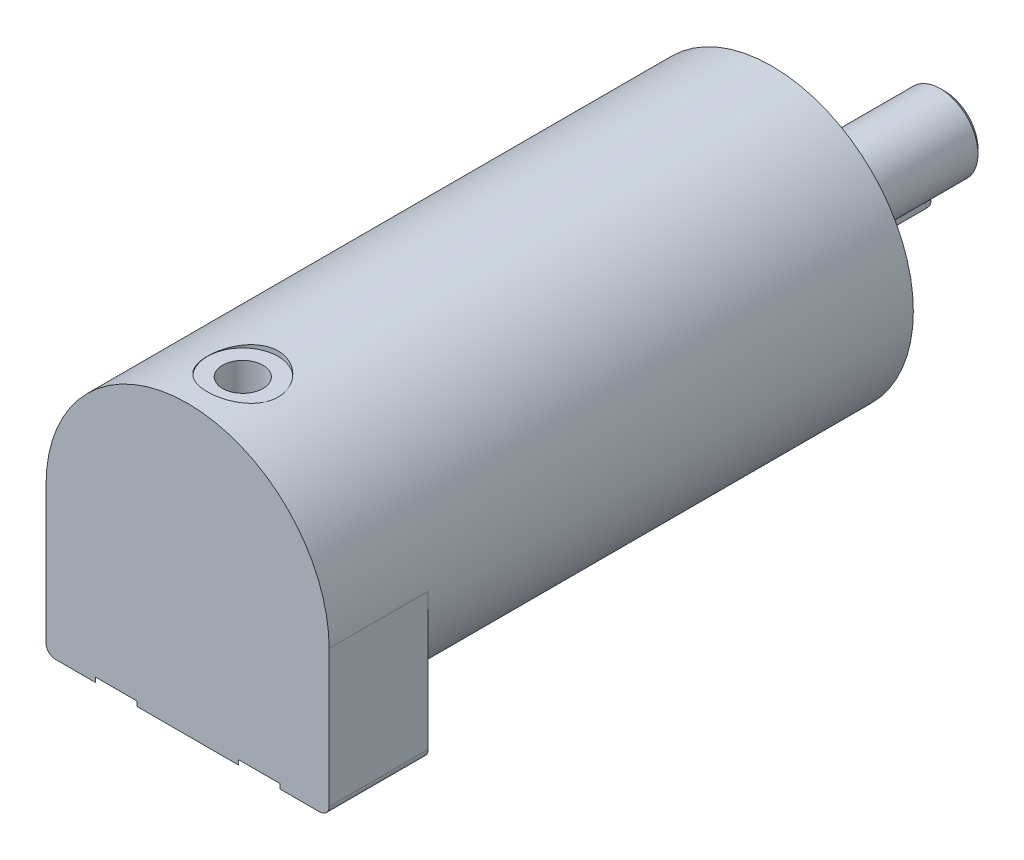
ISO-10303-21;
HEADER;
FILE_DESCRIPTION(('STEP AP214'),'2;1');
FILE_NAME('part.step','',(''),(''),'','','');
FILE_SCHEMA(('AUTOMOTIVE_DESIGN { 1 0 10303 214 1 1 1 1 }'));
ENDSEC;
DATA;
#1=APPLICATION_CONTEXT('core data for automotive mechanical design processes');
#2=APPLICATION_PROTOCOL_DEFINITION('international standard','automotive_design',2000,#1);
#3=PRODUCT_CONTEXT('',#1,'mechanical');
#4=PRODUCT('Part','Part','',(#3));
#5=PRODUCT_RELATED_PRODUCT_CATEGORY('part','',(#4));
#6=PRODUCT_DEFINITION_FORMATION('','',#4);
#7=PRODUCT_DEFINITION_CONTEXT('part definition',#1,'design');
#8=PRODUCT_DEFINITION('design','',#6,#7);
#9=PRODUCT_DEFINITION_SHAPE('','',#8);
#10=(LENGTH_UNIT() NAMED_UNIT(*) SI_UNIT(.MILLI.,.METRE.));
#11=(NAMED_UNIT(*) PLANE_ANGLE_UNIT() SI_UNIT($,.RADIAN.));
#12=(NAMED_UNIT(*) SI_UNIT($,.STERADIAN.) SOLID_ANGLE_UNIT());
#13=UNCERTAINTY_MEASURE_WITH_UNIT(LENGTH_MEASURE(1.E-05),#10,'distance_accuracy_value','');
#14=(GEOMETRIC_REPRESENTATION_CONTEXT(3) GLOBAL_UNCERTAINTY_ASSIGNED_CONTEXT((#13)) GLOBAL_UNIT_ASSIGNED_CONTEXT((#10,
#11,#12)) REPRESENTATION_CONTEXT('',''));
#15=CARTESIAN_POINT('',(0.,0.,0.));
#16=DIRECTION('',(0.,0.,1.));
#17=DIRECTION('',(1.,0.,0.));
#18=AXIS2_PLACEMENT_3D('',#15,#16,#17);
#19=CARTESIAN_POINT('',(0.,0.,0.));
#20=DIRECTION('',(0.,0.,1.));
#21=DIRECTION('',(1.,0.,0.));
#22=AXIS2_PLACEMENT_3D('',#19,#20,#21);
#23=PLANE('',#22);
#24=CARTESIAN_POINT('',(-15.9099025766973,15.9099025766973,0.));
#25=DIRECTION('',(0.,0.,-1.));
#26=DIRECTION('',(-1.,0.,0.));
#27=AXIS2_PLACEMENT_3D('',#24,#25,#26);
#28=CIRCLE('',#27,2.49999999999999);
#29=CARTESIAN_POINT('',(-18.4099025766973,15.9099025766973,0.));
#30=VERTEX_POINT('',#29);
#31=EDGE_CURVE('E187',#30,#30,#28,.T.);
#32=ORIENTED_EDGE('',*,*,#31,.F.);
#33=EDGE_LOOP('',(#32));
#34=FACE_BOUND('',#33,.T.);
#35=CARTESIAN_POINT('',(15.9099025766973,15.9099025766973,0.));
#36=DIRECTION('',(0.,0.,-1.));
#37=DIRECTION('',(-1.,0.,0.));
#38=AXIS2_PLACEMENT_3D('',#35,#36,#37);
#39=CIRCLE('',#38,2.49999999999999);
#40=CARTESIAN_POINT('',(13.4099025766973,15.9099025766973,0.));
#41=VERTEX_POINT('',#40);
#42=EDGE_CURVE('E193',#41,#41,#39,.T.);
#43=ORIENTED_EDGE('',*,*,#42,.F.);
#44=EDGE_LOOP('',(#43));
#45=FACE_BOUND('',#44,.T.);
#46=CARTESIAN_POINT('',(0.,0.,0.));
#47=DIRECTION('',(0.,0.,1.));
#48=DIRECTION('',(1.,0.,0.));
#49=AXIS2_PLACEMENT_3D('',#46,#47,#48);
#50=CIRCLE('',#49,30.);
#51=CARTESIAN_POINT('',(30.,0.,0.));
#52=VERTEX_POINT('',#51);
#53=EDGE_CURVE('E283',#52,#52,#50,.T.);
#54=ORIENTED_EDGE('',*,*,#53,.F.);
#55=EDGE_LOOP('',(#54));
#56=FACE_BOUND('',#55,.T.);
#57=CARTESIAN_POINT('',(0.,0.,0.));
#58=DIRECTION('',(0.,0.,1.));
#59=DIRECTION('',(1.,0.,0.));
#60=AXIS2_PLACEMENT_3D('',#57,#58,#59);
#61=CIRCLE('',#60,15.75);
#62=CARTESIAN_POINT('',(15.75,0.,0.));
#63=VERTEX_POINT('',#62);
#64=EDGE_CURVE('E532',#63,#63,#61,.T.);
#65=ORIENTED_EDGE('',*,*,#64,.T.);
#66=EDGE_LOOP('',(#65));
#67=FACE_BOUND('',#66,.T.);
#68=CARTESIAN_POINT('',(0.,-22.5,0.));
#69=DIRECTION('',(0.,0.,-1.));
#70=DIRECTION('',(-1.,0.,0.));
#71=AXIS2_PLACEMENT_3D('',#68,#69,#70);
#72=CIRCLE('',#71,2.49999999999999);
#73=CARTESIAN_POINT('',(-2.5,-22.5,0.));
#74=VERTEX_POINT('',#73);
#75=EDGE_CURVE('E179',#74,#74,#72,.T.);
#76=ORIENTED_EDGE('',*,*,#75,.F.);
#77=EDGE_LOOP('',(#76));
#78=FACE_BOUND('',#77,.T.);
#79=ADVANCED_FACE('F34',(#34,#45,#56,#67,#78),#23,.F.);
#80=CARTESIAN_POINT('',(0.,0.,123.8));
#81=DIRECTION('',(0.,0.,-1.));
#82=DIRECTION('',(-1.,0.,0.));
#83=AXIS2_PLACEMENT_3D('',#80,#81,#82);
#84=CYLINDRICAL_SURFACE('',#83,30.);
#85=CARTESIAN_POINT('',(0.,0.,123.8));
#86=DIRECTION('',(0.,0.,1.));
#87=DIRECTION('',(1.,0.,0.));
#88=AXIS2_PLACEMENT_3D('',#85,#86,#87);
#89=CIRCLE('',#88,30.);
#90=CARTESIAN_POINT('',(30.,0.,123.8));
#91=VERTEX_POINT('',#90);
#92=CARTESIAN_POINT('',(-30.,0.,123.8));
#93=VERTEX_POINT('',#92);
#94=EDGE_CURVE('E297',#91,#93,#89,.T.);
#95=ORIENTED_EDGE('',*,*,#94,.F.);
#96=DIRECTION('',(0.,0.,1.));
#97=VECTOR('',#96,1.);
#98=CARTESIAN_POINT('',(30.,0.,102.8));
#99=LINE('',#98,#97);
#100=CARTESIAN_POINT('',(30.,0.,102.8));
#101=VERTEX_POINT('',#100);
#102=EDGE_CURVE('E280',#101,#91,#99,.T.);
#103=ORIENTED_EDGE('',*,*,#102,.F.);
#104=CARTESIAN_POINT('',(0.,0.,102.8));
#105=DIRECTION('',(0.,0.,-1.));
#106=DIRECTION('',(1.,0.,0.));
#107=AXIS2_PLACEMENT_3D('',#104,#105,#106);
#108=CIRCLE('',#107,30.);
#109=CARTESIAN_POINT('',(-30.,0.,102.8));
#110=VERTEX_POINT('',#109);
#111=EDGE_CURVE('E259',#101,#110,#108,.T.);
#112=ORIENTED_EDGE('',*,*,#111,.T.);
#113=DIRECTION('',(0.,0.,1.));
#114=VECTOR('',#113,1.);
#115=CARTESIAN_POINT('',(-30.,0.,102.8));
#116=LINE('',#115,#114);
#117=EDGE_CURVE('E279',#110,#93,#116,.T.);
#118=ORIENTED_EDGE('',*,*,#117,.T.);
#119=EDGE_LOOP('',(#95,#103,#112,#118));
#120=FACE_BOUND('',#119,.T.);
#121=ORIENTED_EDGE('',*,*,#53,.T.);
#122=EDGE_LOOP('',(#121));
#123=FACE_BOUND('',#122,.T.);
#124=CARTESIAN_POINT('',(0.,30.,104.6));
#125=CARTESIAN_POINT('',(-0.207256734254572,30.0000037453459,104.599993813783));
#126=CARTESIAN_POINT('',(-0.414445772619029,29.9978490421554,104.608592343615));
#127=CARTESIAN_POINT('',(-0.827372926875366,29.9892986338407,104.642899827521));
#128=CARTESIAN_POINT('',(-1.0331108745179,29.9829024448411,104.668610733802));
#129=CARTESIAN_POINT('',(-1.44164335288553,29.9660390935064,104.73694464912));
#130=CARTESIAN_POINT('',(-1.64443695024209,29.9555706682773,104.779572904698));
#131=CARTESIAN_POINT('',(-2.04566249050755,29.9308482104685,104.881404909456));
#132=CARTESIAN_POINT('',(-2.2440927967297,29.9165927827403,104.940614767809));
#133=CARTESIAN_POINT('',(-2.63482361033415,29.8847130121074,105.075021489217));
#134=CARTESIAN_POINT('',(-2.82713338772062,29.8670940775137,105.150192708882));
#135=CARTESIAN_POINT('',(-3.20473275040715,29.8289408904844,105.316031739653));
#136=CARTESIAN_POINT('',(-3.39001971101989,29.8084055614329,105.406705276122));
#137=CARTESIAN_POINT('',(-3.7522202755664,29.7649811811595,105.602828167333));
#138=CARTESIAN_POINT('',(-3.92913691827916,29.742092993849,105.708272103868));
#139=CARTESIAN_POINT('',(-4.27360568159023,29.6945540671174,105.933264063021));
#140=CARTESIAN_POINT('',(-4.44115419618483,29.6699026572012,106.052817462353));
#141=CARTESIAN_POINT('',(-4.76869838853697,29.619039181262,106.307476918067));
#142=CARTESIAN_POINT('',(-4.92850273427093,29.5928069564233,106.442825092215));
#143=CARTESIAN_POINT('',(-5.23627158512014,29.5399027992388,106.726428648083));
#144=CARTESIAN_POINT('',(-5.38423065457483,29.5132306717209,106.874689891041));
#145=CARTESIAN_POINT('',(-5.66727667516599,29.4601886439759,107.183111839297));
#146=CARTESIAN_POINT('',(-5.80236215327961,29.4338187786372,107.343273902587));
#147=CARTESIAN_POINT('',(-6.05867850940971,29.3821290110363,107.674367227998));
#148=CARTESIAN_POINT('',(-6.17991560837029,29.3568086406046,107.845293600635));
#149=CARTESIAN_POINT('',(-6.40951409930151,29.3075439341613,108.199568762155));
#150=CARTESIAN_POINT('',(-6.51764960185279,29.2836266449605,108.383067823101));
#151=CARTESIAN_POINT('',(-6.71799715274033,29.2383150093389,108.758769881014));
#152=CARTESIAN_POINT('',(-6.81021539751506,29.2169196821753,108.950969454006));
#153=CARTESIAN_POINT('',(-6.97807998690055,29.1772830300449,109.342854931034));
#154=CARTESIAN_POINT('',(-7.05372180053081,29.1590425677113,109.542542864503));
#155=CARTESIAN_POINT('',(-7.18774907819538,29.1262944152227,109.947838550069));
#156=CARTESIAN_POINT('',(-7.24614170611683,29.111785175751,110.153443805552));
#157=CARTESIAN_POINT('',(-7.34423429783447,29.0871918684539,110.565041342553));
#158=CARTESIAN_POINT('',(-7.38427907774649,29.0770264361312,110.770946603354));
#159=CARTESIAN_POINT('',(-7.44698381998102,29.0610302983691,111.185475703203));
#160=CARTESIAN_POINT('',(-7.4696505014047,29.0551979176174,111.394098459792));
#161=CARTESIAN_POINT('',(-7.49742486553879,29.0480434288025,111.812596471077));
#162=CARTESIAN_POINT('',(-7.50253175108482,29.0467215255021,112.022471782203));
#163=CARTESIAN_POINT('',(-7.49513850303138,29.0486301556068,112.441889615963));
#164=CARTESIAN_POINT('',(-7.48263861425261,29.0518606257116,112.651432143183));
#165=CARTESIAN_POINT('',(-7.44066443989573,29.0626386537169,113.063510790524));
#166=CARTESIAN_POINT('',(-7.4116127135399,29.0700787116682,113.266092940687));
#167=CARTESIAN_POINT('',(-7.33708950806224,29.0889771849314,113.668094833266));
#168=CARTESIAN_POINT('',(-7.29161238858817,29.1004369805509,113.867513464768));
#169=CARTESIAN_POINT('',(-7.18462456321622,29.1270356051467,114.261680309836));
#170=CARTESIAN_POINT('',(-7.12311886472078,29.1421732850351,114.456429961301));
#171=CARTESIAN_POINT('',(-6.98451980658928,29.1757016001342,114.840091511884));
#172=CARTESIAN_POINT('',(-6.90742060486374,29.1940934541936,115.029001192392));
#173=CARTESIAN_POINT('',(-6.73739848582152,29.2338015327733,115.40148160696));
#174=CARTESIAN_POINT('',(-6.6443290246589,29.2551444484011,115.584982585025));
#175=CARTESIAN_POINT('',(-6.44353389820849,29.3000247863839,115.943580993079));
#176=CARTESIAN_POINT('',(-6.33580318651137,29.3235629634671,116.118675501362));
#177=CARTESIAN_POINT('',(-6.10645448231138,29.3721798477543,116.459285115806));
#178=CARTESIAN_POINT('',(-5.98483682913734,29.3972585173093,116.624800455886));
#179=CARTESIAN_POINT('',(-5.72851464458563,29.4482799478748,116.945226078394));
#180=CARTESIAN_POINT('',(-5.59380986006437,29.4742227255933,117.100136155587));
#181=CARTESIAN_POINT('',(-5.30812720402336,29.5270296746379,117.402669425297));
#182=CARTESIAN_POINT('',(-5.15679305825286,29.5538989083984,117.549955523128));
#183=CARTESIAN_POINT('',(-4.8422451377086,29.6070614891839,117.831244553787));
#184=CARTESIAN_POINT('',(-4.67903532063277,29.633355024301,117.965251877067));
#185=CARTESIAN_POINT('',(-4.34169745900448,29.6846555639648,118.21917051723));
#186=CARTESIAN_POINT('',(-4.16756501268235,29.7096620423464,118.339076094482));
#187=CARTESIAN_POINT('',(-3.80966849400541,29.7576713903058,118.563826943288));
#188=CARTESIAN_POINT('',(-3.62590818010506,29.7806750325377,118.668678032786));
#189=CARTESIAN_POINT('',(-3.24921184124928,29.8241295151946,118.862965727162));
#190=CARTESIAN_POINT('',(-3.05624322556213,29.8445701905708,118.952341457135));
#191=CARTESIAN_POINT('',(-2.66321164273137,29.8822063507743,119.114447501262));
#192=CARTESIAN_POINT('',(-2.4631513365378,29.8994030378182,119.187183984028));
#193=CARTESIAN_POINT('',(-2.05730133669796,29.9300671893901,119.315455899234));
#194=CARTESIAN_POINT('',(-1.85151145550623,29.9435345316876,119.370990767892));
#195=CARTESIAN_POINT('',(-1.43573434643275,29.9663479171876,119.464377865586));
#196=CARTESIAN_POINT('',(-1.22574722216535,29.9756940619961,119.502230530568));
#197=CARTESIAN_POINT('',(-0.808578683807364,29.9898089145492,119.559180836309));
#198=CARTESIAN_POINT('',(-0.601463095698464,29.9946886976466,119.578733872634));
#199=CARTESIAN_POINT('',(-0.186267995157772,30.0001400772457,119.600567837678));
#200=CARTESIAN_POINT('',(0.0218115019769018,30.000711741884,119.602849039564));
#201=CARTESIAN_POINT('',(0.437389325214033,29.9975310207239,119.59012046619));
#202=CARTESIAN_POINT('',(0.64488769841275,29.9937789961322,119.575112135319));
#203=CARTESIAN_POINT('',(1.05780268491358,29.9820565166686,119.527936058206));
#204=CARTESIAN_POINT('',(1.26321930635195,29.9740860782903,119.495768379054));
#205=CARTESIAN_POINT('',(1.66742320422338,29.9542990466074,119.415157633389));
#206=CARTESIAN_POINT('',(1.86626371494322,29.9425420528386,119.366966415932));
#207=CARTESIAN_POINT('',(2.2591874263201,29.9154620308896,119.254567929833));
#208=CARTESIAN_POINT('',(2.45326899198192,29.9001377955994,119.190355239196));
#209=CARTESIAN_POINT('',(2.83525089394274,29.8663374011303,119.04643774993));
#210=CARTESIAN_POINT('',(3.02315294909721,29.8478621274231,118.966737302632));
#211=CARTESIAN_POINT('',(3.39167896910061,29.8082350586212,118.792389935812));
#212=CARTESIAN_POINT('',(3.57230017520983,29.7870822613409,118.697737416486));
#213=CARTESIAN_POINT('',(3.92811410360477,29.7422701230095,118.492404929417));
#214=CARTESIAN_POINT('',(4.10315786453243,29.7185735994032,118.381474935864));
#215=CARTESIAN_POINT('',(4.44338343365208,29.6696123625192,118.145594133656));
#216=CARTESIAN_POINT('',(4.60856179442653,29.6443471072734,118.02063846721));
#217=CARTESIAN_POINT('',(4.92794065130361,29.5929310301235,117.757579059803));
#218=CARTESIAN_POINT('',(5.08214133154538,29.5667802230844,117.619475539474));
#219=CARTESIAN_POINT('',(5.37858986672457,29.5142920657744,117.33101760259));
#220=CARTESIAN_POINT('',(5.52083758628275,29.4879547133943,117.180663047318));
#221=CARTESIAN_POINT('',(5.79583124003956,29.4351563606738,116.864794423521));
#222=CARTESIAN_POINT('',(5.92825459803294,29.4087084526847,116.698997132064));
#223=CARTESIAN_POINT('',(6.17862451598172,29.3571275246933,116.356706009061));
#224=CARTESIAN_POINT('',(6.29657604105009,29.3319940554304,116.180215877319));
#225=CARTESIAN_POINT('',(6.51724566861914,29.2837544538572,115.817602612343));
#226=CARTESIAN_POINT('',(6.61995840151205,29.2606490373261,115.631476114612));
#227=CARTESIAN_POINT('',(6.80928641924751,29.2171705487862,115.250992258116));
#228=CARTESIAN_POINT('',(6.89590814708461,29.1967963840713,115.056638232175));
#229=CARTESIAN_POINT('',(7.05197723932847,29.1594928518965,114.662102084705));
#230=CARTESIAN_POINT('',(7.12151832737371,29.142544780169,114.461958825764));
#231=CARTESIAN_POINT('',(7.24345651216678,29.1124764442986,114.056316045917));
#232=CARTESIAN_POINT('',(7.29586020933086,29.0993547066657,113.850818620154));
#233=CARTESIAN_POINT('',(7.38310953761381,29.0773403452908,113.435902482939));
#234=CARTESIAN_POINT('',(7.41795501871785,29.0684477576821,113.226483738));
#235=CARTESIAN_POINT('',(7.46977632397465,29.0551744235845,112.805306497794));
#236=CARTESIAN_POINT('',(7.48675257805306,29.0507935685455,112.593548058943));
#237=CARTESIAN_POINT('',(7.50245275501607,29.0467427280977,112.175451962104));
#238=CARTESIAN_POINT('',(7.50169050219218,29.0469401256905,111.969134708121));
#239=CARTESIAN_POINT('',(7.48317627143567,29.0517153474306,111.557242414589));
#240=CARTESIAN_POINT('',(7.46541843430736,29.0562946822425,111.351667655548));
#241=CARTESIAN_POINT('',(7.41306667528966,29.0696950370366,110.942897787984));
#242=CARTESIAN_POINT('',(7.37847936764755,29.0785143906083,110.739701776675));
#243=CARTESIAN_POINT('',(7.2927454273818,29.1001342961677,110.336972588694));
#244=CARTESIAN_POINT('',(7.24159263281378,29.1129363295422,110.137440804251));
#245=CARTESIAN_POINT('',(7.12352281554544,29.1420502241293,109.744751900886));
#246=CARTESIAN_POINT('',(7.0567078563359,29.1583393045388,109.551562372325));
#247=CARTESIAN_POINT('',(6.90762983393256,29.1940151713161,109.171461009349));
#248=CARTESIAN_POINT('',(6.82536149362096,29.2134030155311,108.984551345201));
#249=CARTESIAN_POINT('',(6.64600134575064,29.2547283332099,108.618299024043));
#250=CARTESIAN_POINT('',(6.54891059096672,29.2766656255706,108.43895583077));
#251=CARTESIAN_POINT('',(6.34057791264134,29.3224903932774,108.088946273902));
#252=CARTESIAN_POINT('',(6.2293356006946,29.3463779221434,107.918280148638));
#253=CARTESIAN_POINT('',(5.99034243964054,29.3961065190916,107.582323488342));
#254=CARTESIAN_POINT('',(5.86223474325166,29.42198241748,107.417291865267));
#255=CARTESIAN_POINT('',(5.59280739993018,29.4743842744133,107.098596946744));
#256=CARTESIAN_POINT('',(5.45149196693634,29.5009100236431,106.944930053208));
#257=CARTESIAN_POINT('',(5.15645532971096,29.5539073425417,106.649813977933));
#258=CARTESIAN_POINT('',(5.00272698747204,29.580378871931,106.508371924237));
#259=CARTESIAN_POINT('',(4.68398990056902,29.6325210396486,106.238789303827));
#260=CARTESIAN_POINT('',(4.51898526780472,29.6581919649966,106.110643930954));
#261=CARTESIAN_POINT('',(4.17555233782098,29.7085076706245,105.866221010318));
#262=CARTESIAN_POINT('',(3.99693193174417,29.7331246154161,105.750207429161));
#263=CARTESIAN_POINT('',(3.6303206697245,29.7801093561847,105.533716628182));
#264=CARTESIAN_POINT('',(3.44233329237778,29.8024779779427,105.433233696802));
#265=CARTESIAN_POINT('',(3.05829616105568,29.8443309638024,105.248563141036));
#266=CARTESIAN_POINT('',(2.86224992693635,29.8638165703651,105.164368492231));
#267=CARTESIAN_POINT('',(2.46348752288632,29.8993536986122,105.012917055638));
#268=CARTESIAN_POINT('',(2.26077236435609,29.9154057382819,104.945657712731));
#269=CARTESIAN_POINT('',(1.72222038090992,29.9523811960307,104.792208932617));
#270=CARTESIAN_POINT('',(1.38198934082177,29.9701268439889,104.720255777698));
#271=CARTESIAN_POINT('',(0.694441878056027,29.9939326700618,104.624158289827));
#272=CARTESIAN_POINT('',(0.347125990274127,29.9999937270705,104.600010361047));
#273=CARTESIAN_POINT('',(0.,30.,104.6));
#274=B_SPLINE_CURVE_WITH_KNOTS('',3,(#124,#125,#126,#127,#128,#129,#130,#131,#132,#133,#134,
#135,#136,#137,#138,#139,#140,#141,#142,#143,#144,#145,#146,#147,#148,#149,#150,#151,#152,#153,
#154,#155,#156,#157,#158,#159,#160,#161,#162,#163,#164,#165,#166,#167,#168,#169,#170,#171,#172,
#173,#174,#175,#176,#177,#178,#179,#180,#181,#182,#183,#184,#185,#186,#187,#188,#189,#190,#191,
#192,#193,#194,#195,#196,#197,#198,#199,#200,#201,#202,#203,#204,#205,#206,#207,#208,#209,#210,
#211,#212,#213,#214,#215,#216,#217,#218,#219,#220,#221,#222,#223,#224,#225,#226,#227,#228,#229,
#230,#231,#232,#233,#234,#235,#236,#237,#238,#239,#240,#241,#242,#243,#244,#245,#246,#247,#248,
#249,#250,#251,#252,#253,#254,#255,#256,#257,#258,#259,#260,#261,#262,#263,#264,#265,#266,#267,
#268,#269,#270,#271,#272,#273),.UNSPECIFIED.,.T.,.F.,(4,2,2,2,2,2,2,2,2,2,2,2,2,2,2,2,2,2,2,2,2,
2,2,2,2,2,2,2,2,2,2,2,2,2,2,2,2,2,2,2,2,2,2,2,2,2,2,2,2,2,2,2,2,2,2,2,2,2,2,2,2,2,2,2,2,2,2,2,2,
2,2,2,2,2,4),(0.,0.621464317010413,1.24299954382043,1.86472767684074,2.48668517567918,
3.10765090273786,3.72884646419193,4.34981474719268,4.97102043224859,5.60345785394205,
6.23618384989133,6.86898215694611,7.5014950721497,8.14370490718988,8.78566416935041,
9.42779868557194,10.0696661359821,10.698918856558,11.3279281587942,11.9569660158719,
12.5859951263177,13.1996422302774,13.813500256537,14.427166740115,15.0410635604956,
15.6609283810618,16.2810071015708,16.9010706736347,17.5211462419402,18.1590318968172,
18.7967059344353,19.4346386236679,20.072324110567,20.7124637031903,21.3523655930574,
21.9922884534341,22.6321955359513,23.2557181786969,23.8792309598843,24.502691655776,
25.1261499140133,25.7402389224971,26.3545360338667,26.9686608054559,27.5830161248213,
28.2080518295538,28.8333046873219,29.4585470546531,30.0837965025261,30.7245311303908,
31.3650453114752,32.0057846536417,32.6462668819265,33.2831519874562,33.9197915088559,
34.5564364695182,35.1930661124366,35.8112783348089,36.4297037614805,37.0478863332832,
37.6662991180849,38.2807888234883,38.8954887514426,39.5101450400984,40.1248182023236,
40.7556352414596,41.3862517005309,42.0172334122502,42.6479862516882,43.2904290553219,
43.9326350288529,44.5745634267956,45.2163949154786,46.2573388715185,47.298204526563),.UNSPECIFIED.);
#275=CARTESIAN_POINT('',(0.,30.,104.6));
#276=VERTEX_POINT('',#275);
#277=EDGE_CURVE('E417',#276,#276,#274,.T.);
#278=ORIENTED_EDGE('',*,*,#277,.F.);
#279=EDGE_LOOP('',(#278));
#280=FACE_BOUND('',#279,.T.);
#281=ADVANCED_FACE('F398',(#120,#123,#280),#84,.T.);
#282=CARTESIAN_POINT('',(-28.,-31.,102.8));
#283=DIRECTION('',(0.,-1.,0.));
#284=DIRECTION('',(1.,0.,0.));
#285=AXIS2_PLACEMENT_3D('',#282,#283,#284);
#286=PLANE('',#285);
#287=CARTESIAN_POINT('',(15.15,-31.,112.1));
#288=DIRECTION('',(0.,-1.,0.));
#289=DIRECTION('',(1.,0.,0.));
#290=AXIS2_PLACEMENT_3D('',#287,#288,#289);
#291=CIRCLE('',#290,12.5);
#292=CARTESIAN_POINT('',(10.75,-31.,123.8));
#293=VERTEX_POINT('',#292);
#294=CARTESIAN_POINT('',(6.79775479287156,-31.,102.8));
#295=VERTEX_POINT('',#294);
#296=EDGE_CURVE('E219',#293,#295,#291,.T.);
#297=ORIENTED_EDGE('',*,*,#296,.F.);
#298=DIRECTION('',(1.,0.,0.));
#299=VECTOR('',#298,1.);
#300=CARTESIAN_POINT('',(-28.,-31.,123.8));
#301=LINE('',#300,#299);
#302=CARTESIAN_POINT('',(-10.75,-31.,123.8));
#303=VERTEX_POINT('',#302);
#304=EDGE_CURVE('E254',#303,#293,#301,.T.);
#305=ORIENTED_EDGE('',*,*,#304,.F.);
#306=CARTESIAN_POINT('',(-15.15,-31.,112.1));
#307=DIRECTION('',(0.,-1.,0.));
#308=DIRECTION('',(1.,0.,0.));
#309=AXIS2_PLACEMENT_3D('',#306,#307,#308);
#310=CIRCLE('',#309,12.5);
#311=CARTESIAN_POINT('',(-6.79775479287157,-31.,102.8));
#312=VERTEX_POINT('',#311);
#313=EDGE_CURVE('E230',#312,#303,#310,.T.);
#314=ORIENTED_EDGE('',*,*,#313,.F.);
#315=DIRECTION('',(1.,0.,0.));
#316=VECTOR('',#315,1.);
#317=CARTESIAN_POINT('',(-28.,-31.,102.8));
#318=LINE('',#317,#316);
#319=EDGE_CURVE('E273',#312,#295,#318,.T.);
#320=ORIENTED_EDGE('',*,*,#319,.T.);
#321=EDGE_LOOP('',(#297,#305,#314,#320));
#322=FACE_BOUND('',#321,.T.);
#323=ADVANCED_FACE('F404',(#322),#286,.T.);
#324=CARTESIAN_POINT('',(-19.55,-31.,123.8));
#325=VERTEX_POINT('',#324);
#326=CARTESIAN_POINT('',(-23.5022452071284,-31.,102.8));
#327=VERTEX_POINT('',#326);
#328=EDGE_CURVE('E232',#325,#327,#310,.T.);
#329=ORIENTED_EDGE('',*,*,#328,.F.);
#330=CARTESIAN_POINT('',(-28.,-31.,123.8));
#331=VERTEX_POINT('',#330);
#332=EDGE_CURVE('E250',#331,#325,#301,.T.);
#333=ORIENTED_EDGE('',*,*,#332,.F.);
#334=DIRECTION('',(0.,0.,1.));
#335=VECTOR('',#334,1.);
#336=CARTESIAN_POINT('',(-28.,-31.,102.8));
#337=LINE('',#336,#335);
#338=CARTESIAN_POINT('',(-28.,-31.,102.8));
#339=VERTEX_POINT('',#338);
#340=EDGE_CURVE('E289',#339,#331,#337,.T.);
#341=ORIENTED_EDGE('',*,*,#340,.F.);
#342=EDGE_CURVE('E269',#339,#327,#318,.T.);
#343=ORIENTED_EDGE('',*,*,#342,.T.);
#344=EDGE_LOOP('',(#329,#333,#341,#343));
#345=FACE_BOUND('',#344,.T.);
#346=ADVANCED_FACE('F381',(#345),#286,.T.);
#347=CARTESIAN_POINT('',(0.,0.,0.));
#348=DIRECTION('',(0.,0.,1.));
#349=DIRECTION('',(1.,0.,0.));
#350=AXIS2_PLACEMENT_3D('',#347,#348,#349);
#351=CYLINDRICAL_SURFACE('',#350,8.);
#352=CARTESIAN_POINT('',(0.,0.,-7.7));
#353=DIRECTION('',(0.,0.,1.));
#354=DIRECTION('',(1.,0.,0.));
#355=AXIS2_PLACEMENT_3D('',#352,#353,#354);
#356=CIRCLE('',#355,8.);
#357=CARTESIAN_POINT('',(8.,0.,-7.7));
#358=VERTEX_POINT('',#357);
#359=EDGE_CURVE('E541',#358,#358,#356,.T.);
#360=ORIENTED_EDGE('',*,*,#359,.F.);
#361=EDGE_LOOP('',(#360));
#362=FACE_BOUND('',#361,.T.);
#363=CARTESIAN_POINT('',(0.,0.,-35.7));
#364=DIRECTION('',(0.,0.,1.));
#365=DIRECTION('',(1.,0.,0.));
#366=AXIS2_PLACEMENT_3D('',#363,#364,#365);
#367=CIRCLE('',#366,8.);
#368=CARTESIAN_POINT('',(8.,0.,-35.7));
#369=VERTEX_POINT('',#368);
#370=EDGE_CURVE('E529',#369,#369,#367,.T.);
#371=ORIENTED_EDGE('',*,*,#370,.T.);
#372=EDGE_LOOP('',(#371));
#373=FACE_BOUND('',#372,.T.);
#374=DIRECTION('',(0.,0.,1.));
#375=VECTOR('',#374,1.);
#376=CARTESIAN_POINT('',(2.5,-7.59934207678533,0.));
#377=LINE('',#376,#375);
#378=CARTESIAN_POINT('',(2.5,-7.59934207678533,-18.7));
#379=VERTEX_POINT('',#378);
#380=CARTESIAN_POINT('',(2.5,-7.59934207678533,-30.2));
#381=VERTEX_POINT('',#380);
#382=EDGE_CURVE('E329',#379,#381,#377,.F.);
#383=ORIENTED_EDGE('',*,*,#382,.T.);
#384=CARTESIAN_POINT('',(2.5,-7.59934207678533,-30.2));
#385=CARTESIAN_POINT('',(2.5000087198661,-7.59933203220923,-30.2684660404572));
#386=CARTESIAN_POINT('',(2.49718761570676,-7.60026710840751,-30.3369263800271));
#387=CARTESIAN_POINT('',(2.48595363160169,-7.60395280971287,-30.4733214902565));
#388=CARTESIAN_POINT('',(2.47754209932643,-7.60670299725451,-30.5412563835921));
#389=CARTESIAN_POINT('',(2.45522504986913,-7.61393458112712,-30.6759389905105));
#390=CARTESIAN_POINT('',(2.4413343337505,-7.61841131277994,-30.7426894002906));
#391=CARTESIAN_POINT('',(2.40819742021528,-7.62895048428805,-30.8747019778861));
#392=CARTESIAN_POINT('',(2.38895106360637,-7.63501297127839,-30.9399641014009));
#393=CARTESIAN_POINT('',(2.32342181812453,-7.65531370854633,-31.1327877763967));
#394=CARTESIAN_POINT('',(2.26931834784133,-7.6716757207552,-31.2575680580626));
#395=CARTESIAN_POINT('',(2.14195853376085,-7.7082019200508,-31.4962875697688));
#396=CARTESIAN_POINT('',(2.06869223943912,-7.72836808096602,-31.6102211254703));
#397=CARTESIAN_POINT('',(1.90239488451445,-7.77100200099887,-31.8279499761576));
#398=CARTESIAN_POINT('',(1.808822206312,-7.79352168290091,-31.9313222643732));
#399=CARTESIAN_POINT('',(1.60572727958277,-7.83788426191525,-32.1211908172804));
#400=CARTESIAN_POINT('',(1.49620229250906,-7.85972704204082,-32.2076841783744));
#401=CARTESIAN_POINT('',(1.26124953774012,-7.90087147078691,-32.363223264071));
#402=CARTESIAN_POINT('',(1.13551807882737,-7.92010445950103,-32.4318300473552));
#403=CARTESIAN_POINT('',(0.873602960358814,-7.95325160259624,-32.5467540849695));
#404=CARTESIAN_POINT('',(0.737422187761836,-7.96716721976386,-32.5930774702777));
#405=CARTESIAN_POINT('',(0.462930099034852,-7.98774341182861,-32.660701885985));
#406=CARTESIAN_POINT('',(0.324814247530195,-7.99461464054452,-32.6827310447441));
#407=CARTESIAN_POINT('',(0.04668447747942,-8.00107192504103,-32.7034487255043));
#408=CARTESIAN_POINT('',(-0.0933290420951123,-8.00065948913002,-32.7021420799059));
#409=CARTESIAN_POINT('',(-0.366149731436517,-7.9927423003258,-32.6767033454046));
#410=CARTESIAN_POINT('',(-0.499038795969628,-7.98548293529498,-32.6533609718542));
#411=CARTESIAN_POINT('',(-0.758907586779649,-7.96498949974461,-32.5858095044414));
#412=CARTESIAN_POINT('',(-0.885886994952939,-7.95175510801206,-32.5415992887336));
#413=CARTESIAN_POINT('',(-1.13215685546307,-7.92046911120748,-32.4330593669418));
#414=CARTESIAN_POINT('',(-1.25133405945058,-7.90236047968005,-32.3684898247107));
#415=CARTESIAN_POINT('',(-1.47740616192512,-7.86323423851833,-32.2212568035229));
#416=CARTESIAN_POINT('',(-1.58429807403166,-7.84221592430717,-32.1385889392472));
#417=CARTESIAN_POINT('',(-1.78746586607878,-7.79847545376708,-31.9534618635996));
#418=CARTESIAN_POINT('',(-1.88311543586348,-7.77571879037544,-31.8503225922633));
#419=CARTESIAN_POINT('',(-2.05596538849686,-7.73181622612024,-31.6292296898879));
#420=CARTESIAN_POINT('',(-2.13316021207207,-7.71067081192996,-31.5112716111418));
#421=CARTESIAN_POINT('',(-2.26764925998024,-7.67220528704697,-31.2620970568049));
#422=CARTESIAN_POINT('',(-2.3247002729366,-7.65493278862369,-31.1307416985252));
#423=CARTESIAN_POINT('',(-2.41560912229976,-7.6267381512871,-30.8596881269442));
#424=CARTESIAN_POINT('',(-2.4495027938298,-7.61580620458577,-30.7200031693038));
#425=CARTESIAN_POINT('',(-2.48078343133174,-7.60564225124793,-30.5158248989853));
#426=CARTESIAN_POINT('',(-2.48798807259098,-7.60328541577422,-30.452855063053));
#427=CARTESIAN_POINT('',(-2.49759244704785,-7.60013482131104,-30.3266010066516));
#428=CARTESIAN_POINT('',(-2.4999989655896,-7.59933885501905,-30.2633173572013));
#429=CARTESIAN_POINT('',(-2.5,-7.59934207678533,-30.2));
#430=B_SPLINE_CURVE_WITH_KNOTS('',3,(#384,#385,#386,#387,#388,#389,#390,#391,#392,#393,#394,
#395,#396,#397,#398,#399,#400,#401,#402,#403,#404,#405,#406,#407,#408,#409,#410,#411,#412,#413,
#414,#415,#416,#417,#418,#419,#420,#421,#422,#423,#424,#425,#426,#427,#428,#429),.UNSPECIFIED.,
.F.,.F.,(4,2,2,2,2,2,2,2,2,2,2,2,2,2,2,2,2,2,2,2,2,2,4),(0.,0.205323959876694,0.410598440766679,
0.615322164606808,0.82005197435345,1.22896577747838,1.63809233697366,2.05988351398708,
2.48174718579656,2.91315381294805,3.34444167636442,3.76241894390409,4.1803096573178,
4.58377069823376,4.98725343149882,5.39567896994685,5.80420358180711,6.22971654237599,
6.65535752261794,7.08597472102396,7.51592403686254,7.70602799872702,7.89586293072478),.UNSPECIFIED.);
#431=CARTESIAN_POINT('',(-2.5,-7.59934207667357,-30.2));
#432=VERTEX_POINT('',#431);
#433=EDGE_CURVE('E341',#381,#432,#430,.T.);
#434=ORIENTED_EDGE('',*,*,#433,.T.);
#435=DIRECTION('',(0.,0.,1.));
#436=VECTOR('',#435,1.);
#437=CARTESIAN_POINT('',(-2.5,-7.59934207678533,0.));
#438=LINE('',#437,#436);
#439=CARTESIAN_POINT('',(-2.5,-7.59934207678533,-18.7));
#440=VERTEX_POINT('',#439);
#441=EDGE_CURVE('E300',#432,#440,#438,.T.);
#442=ORIENTED_EDGE('',*,*,#441,.T.);
#443=CARTESIAN_POINT('',(-2.5,-7.59934207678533,-18.7));
#444=CARTESIAN_POINT('',(-2.5000087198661,-7.59933203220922,-18.6315339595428));
#445=CARTESIAN_POINT('',(-2.49718761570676,-7.6002671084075,-18.5630736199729));
#446=CARTESIAN_POINT('',(-2.48595363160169,-7.60395280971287,-18.4266785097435));
#447=CARTESIAN_POINT('',(-2.47754209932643,-7.60670299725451,-18.3587436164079));
#448=CARTESIAN_POINT('',(-2.45522504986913,-7.61393458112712,-18.2240610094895));
#449=CARTESIAN_POINT('',(-2.4413343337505,-7.61841131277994,-18.1573105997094));
#450=CARTESIAN_POINT('',(-2.40819742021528,-7.62895048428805,-18.0252980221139));
#451=CARTESIAN_POINT('',(-2.38895106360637,-7.63501297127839,-17.9600358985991));
#452=CARTESIAN_POINT('',(-2.32342181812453,-7.65531370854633,-17.7672122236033));
#453=CARTESIAN_POINT('',(-2.26931834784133,-7.67167572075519,-17.6424319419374));
#454=CARTESIAN_POINT('',(-2.14195853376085,-7.7082019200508,-17.4037124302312));
#455=CARTESIAN_POINT('',(-2.06869223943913,-7.72836808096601,-17.2897788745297));
#456=CARTESIAN_POINT('',(-1.90239488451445,-7.77100200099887,-17.0720500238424));
#457=CARTESIAN_POINT('',(-1.808822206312,-7.7935216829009,-16.9686777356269));
#458=CARTESIAN_POINT('',(-1.60572727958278,-7.83788426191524,-16.7788091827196));
#459=CARTESIAN_POINT('',(-1.49620229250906,-7.85972704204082,-16.6923158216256));
#460=CARTESIAN_POINT('',(-1.26124953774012,-7.90087147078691,-16.536776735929));
#461=CARTESIAN_POINT('',(-1.13551807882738,-7.92010445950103,-16.4681699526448));
#462=CARTESIAN_POINT('',(-0.873602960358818,-7.95325160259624,-16.3532459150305));
#463=CARTESIAN_POINT('',(-0.737422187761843,-7.96716721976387,-16.3069225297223));
#464=CARTESIAN_POINT('',(-0.46293009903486,-7.98774341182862,-16.239298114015));
#465=CARTESIAN_POINT('',(-0.324814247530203,-7.99461464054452,-16.2172689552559));
#466=CARTESIAN_POINT('',(-0.0466844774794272,-8.00107192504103,-16.1965512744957));
#467=CARTESIAN_POINT('',(0.0933290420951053,-8.00065948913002,-16.1978579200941));
#468=CARTESIAN_POINT('',(0.366149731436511,-7.9927423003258,-16.2232966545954));
#469=CARTESIAN_POINT('',(0.499038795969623,-7.98548293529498,-16.2466390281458));
#470=CARTESIAN_POINT('',(0.758907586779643,-7.96498949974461,-16.3141904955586));
#471=CARTESIAN_POINT('',(0.885886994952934,-7.95175510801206,-16.3584007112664));
#472=CARTESIAN_POINT('',(1.13215685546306,-7.92046911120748,-16.4669406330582));
#473=CARTESIAN_POINT('',(1.25133405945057,-7.90236047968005,-16.5315101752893));
#474=CARTESIAN_POINT('',(1.47740616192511,-7.86323423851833,-16.6787431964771));
#475=CARTESIAN_POINT('',(1.58429807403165,-7.84221592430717,-16.7614110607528));
#476=CARTESIAN_POINT('',(1.78746586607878,-7.79847545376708,-16.9465381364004));
#477=CARTESIAN_POINT('',(1.88311543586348,-7.77571879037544,-17.0496774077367));
#478=CARTESIAN_POINT('',(2.05596538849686,-7.73181622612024,-17.2707703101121));
#479=CARTESIAN_POINT('',(2.13316021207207,-7.71067081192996,-17.3887283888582));
#480=CARTESIAN_POINT('',(2.26764925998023,-7.67220528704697,-17.6379029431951));
#481=CARTESIAN_POINT('',(2.3247002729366,-7.65493278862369,-17.7692583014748));
#482=CARTESIAN_POINT('',(2.41560912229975,-7.6267381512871,-18.0403118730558));
#483=CARTESIAN_POINT('',(2.44950279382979,-7.61580620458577,-18.1799968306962));
#484=CARTESIAN_POINT('',(2.48078343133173,-7.60564225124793,-18.3841751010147));
#485=CARTESIAN_POINT('',(2.48798807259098,-7.60328541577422,-18.447144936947));
#486=CARTESIAN_POINT('',(2.49759244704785,-7.60013482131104,-18.5733989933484));
#487=CARTESIAN_POINT('',(2.4999989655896,-7.59933885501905,-18.6366826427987));
#488=CARTESIAN_POINT('',(2.5,-7.59934207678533,-18.7));
#489=B_SPLINE_CURVE_WITH_KNOTS('',3,(#443,#444,#445,#446,#447,#448,#449,#450,#451,#452,#453,
#454,#455,#456,#457,#458,#459,#460,#461,#462,#463,#464,#465,#466,#467,#468,#469,#470,#471,#472,
#473,#474,#475,#476,#477,#478,#479,#480,#481,#482,#483,#484,#485,#486,#487,#488),.UNSPECIFIED.,
.F.,.F.,(4,2,2,2,2,2,2,2,2,2,2,2,2,2,2,2,2,2,2,2,2,2,4),(0.,0.205323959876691,0.410598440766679,
0.615322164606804,0.820051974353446,1.22896577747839,1.63809233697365,2.05988351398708,
2.48174718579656,2.91315381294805,3.34444167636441,3.76241894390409,4.18030965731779,
4.58377069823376,4.98725343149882,5.39567896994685,5.8042035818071,6.22971654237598,
6.65535752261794,7.08597472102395,7.51592403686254,7.70602799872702,7.89586293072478),.UNSPECIFIED.);
#490=EDGE_CURVE('E322',#440,#379,#489,.T.);
#491=ORIENTED_EDGE('',*,*,#490,.T.);
#492=EDGE_LOOP('',(#383,#434,#442,#491));
#493=FACE_BOUND('',#492,.T.);
#494=ADVANCED_FACE('F378',(#362,#373,#493),#351,.T.);
#495=CARTESIAN_POINT('',(0.,0.,0.));
#496=DIRECTION('',(0.,0.,1.));
#497=DIRECTION('',(1.,0.,0.));
#498=AXIS2_PLACEMENT_3D('',#495,#496,#497);
#499=CYLINDRICAL_SURFACE('',#498,15.75);
#500=CARTESIAN_POINT('',(0.,0.,-4.));
#501=DIRECTION('',(0.,0.,1.));
#502=DIRECTION('',(1.,0.,0.));
#503=AXIS2_PLACEMENT_3D('',#500,#501,#502);
#504=CIRCLE('',#503,15.75);
#505=CARTESIAN_POINT('',(15.75,0.,-4.));
#506=VERTEX_POINT('',#505);
#507=EDGE_CURVE('E42',#506,#506,#504,.T.);
#508=ORIENTED_EDGE('',*,*,#507,.T.);
#509=EDGE_LOOP('',(#508));
#510=FACE_BOUND('',#509,.T.);
#511=ORIENTED_EDGE('',*,*,#64,.F.);
#512=EDGE_LOOP('',(#511));
#513=FACE_BOUND('',#512,.T.);
#514=ADVANCED_FACE('F36',(#510,#513),#499,.T.);
#515=CARTESIAN_POINT('',(0.,15.75,-5.));
#516=DIRECTION('',(0.,0.,1.));
#517=DIRECTION('',(1.,0.,0.));
#518=AXIS2_PLACEMENT_3D('',#515,#516,#517);
#519=PLANE('',#518);
#520=CARTESIAN_POINT('',(0.,0.,-5.));
#521=DIRECTION('',(0.,0.,1.));
#522=DIRECTION('',(1.,0.,0.));
#523=AXIS2_PLACEMENT_3D('',#520,#521,#522);
#524=CIRCLE('',#523,14.75);
#525=CARTESIAN_POINT('',(14.75,0.,-5.));
#526=VERTEX_POINT('',#525);
#527=EDGE_CURVE('E11',#526,#526,#524,.F.);
#528=ORIENTED_EDGE('',*,*,#527,.T.);
#529=EDGE_LOOP('',(#528));
#530=FACE_BOUND('',#529,.T.);
#531=CARTESIAN_POINT('',(0.,0.,-5.));
#532=DIRECTION('',(0.,0.,1.));
#533=DIRECTION('',(1.,0.,0.));
#534=AXIS2_PLACEMENT_3D('',#531,#532,#533);
#535=CIRCLE('',#534,8.5);
#536=CARTESIAN_POINT('',(8.5,0.,-5.));
#537=VERTEX_POINT('',#536);
#538=EDGE_CURVE('E535',#537,#537,#535,.T.);
#539=ORIENTED_EDGE('',*,*,#538,.T.);
#540=EDGE_LOOP('',(#539));
#541=FACE_BOUND('',#540,.T.);
#542=ADVANCED_FACE('F388',(#530,#541),#519,.F.);
#543=CARTESIAN_POINT('',(0.,0.,0.));
#544=DIRECTION('',(0.,0.,1.));
#545=DIRECTION('',(1.,0.,0.));
#546=AXIS2_PLACEMENT_3D('',#543,#544,#545);
#547=CYLINDRICAL_SURFACE('',#546,8.5);
#548=ORIENTED_EDGE('',*,*,#538,.F.);
#549=EDGE_LOOP('',(#548));
#550=FACE_BOUND('',#549,.T.);
#551=CARTESIAN_POINT('',(0.,0.,-7.7));
#552=DIRECTION('',(0.,0.,1.));
#553=DIRECTION('',(1.,0.,0.));
#554=AXIS2_PLACEMENT_3D('',#551,#552,#553);
#555=CIRCLE('',#554,8.5);
#556=CARTESIAN_POINT('',(8.5,0.,-7.7));
#557=VERTEX_POINT('',#556);
#558=EDGE_CURVE('E538',#557,#557,#555,.T.);
#559=ORIENTED_EDGE('',*,*,#558,.T.);
#560=EDGE_LOOP('',(#559));
#561=FACE_BOUND('',#560,.T.);
#562=ADVANCED_FACE('F385',(#550,#561),#547,.T.);
#563=CARTESIAN_POINT('',(0.,8.5,-7.7));
#564=DIRECTION('',(0.,0.,1.));
#565=DIRECTION('',(1.,0.,0.));
#566=AXIS2_PLACEMENT_3D('',#563,#564,#565);
#567=PLANE('',#566);
#568=ORIENTED_EDGE('',*,*,#558,.F.);
#569=EDGE_LOOP('',(#568));
#570=FACE_BOUND('',#569,.T.);
#571=ORIENTED_EDGE('',*,*,#359,.T.);
#572=EDGE_LOOP('',(#571));
#573=FACE_BOUND('',#572,.T.);
#574=ADVANCED_FACE('F376',(#570,#573),#567,.F.);
#575=CARTESIAN_POINT('',(0.,8.,-36.7));
#576=DIRECTION('',(0.,0.,1.));
#577=DIRECTION('',(1.,0.,0.));
#578=AXIS2_PLACEMENT_3D('',#575,#576,#577);
#579=PLANE('',#578);
#580=CARTESIAN_POINT('',(0.,0.,-36.7));
#581=DIRECTION('',(0.,0.,-1.));
#582=DIRECTION('',(-1.,0.,0.));
#583=AXIS2_PLACEMENT_3D('',#580,#581,#582);
#584=CIRCLE('',#583,3.5);
#585=CARTESIAN_POINT('',(-3.5,0.,-36.7));
#586=VERTEX_POINT('',#585);
#587=EDGE_CURVE('E304',#586,#586,#584,.T.);
#588=ORIENTED_EDGE('',*,*,#587,.F.);
#589=EDGE_LOOP('',(#588));
#590=FACE_BOUND('',#589,.T.);
#591=CARTESIAN_POINT('',(0.,0.,-36.7));
#592=DIRECTION('',(0.,0.,1.));
#593=DIRECTION('',(1.,0.,0.));
#594=AXIS2_PLACEMENT_3D('',#591,#592,#593);
#595=CIRCLE('',#594,6.99999999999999);
#596=CARTESIAN_POINT('',(6.99999999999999,0.,-36.7));
#597=VERTEX_POINT('',#596);
#598=EDGE_CURVE('E526',#597,#597,#595,.F.);
#599=ORIENTED_EDGE('',*,*,#598,.T.);
#600=EDGE_LOOP('',(#599));
#601=FACE_BOUND('',#600,.T.);
#602=ADVANCED_FACE('F372',(#590,#601),#579,.F.);
#603=CARTESIAN_POINT('',(0.,0.,-35.7));
#604=DIRECTION('',(0.,0.,1.));
#605=DIRECTION('',(1.,0.,0.));
#606=AXIS2_PLACEMENT_3D('',#603,#604,#605);
#607=CONICAL_SURFACE('',#606,8.,0.785398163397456);
#608=ORIENTED_EDGE('',*,*,#598,.F.);
#609=EDGE_LOOP('',(#608));
#610=FACE_BOUND('',#609,.T.);
#611=ORIENTED_EDGE('',*,*,#370,.F.);
#612=EDGE_LOOP('',(#611));
#613=FACE_BOUND('',#612,.T.);
#614=ADVANCED_FACE('F368',(#610,#613),#607,.T.);
#615=CARTESIAN_POINT('',(0.,0.,-17.7));
#616=DIRECTION('',(0.,0.,-1.));
#617=DIRECTION('',(-1.,0.,0.));
#618=AXIS2_PLACEMENT_3D('',#615,#616,#617);
#619=CONICAL_SURFACE('',#618,2.49999999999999,1.02974425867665);
#620=CARTESIAN_POINT('',(0.,0.,-16.1978484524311));
#621=VERTEX_POINT('',#620);
#622=VERTEX_LOOP('',#621);
#623=FACE_BOUND('',#622,.T.);
#624=CARTESIAN_POINT('',(0.,0.,-17.7));
#625=DIRECTION('',(0.,0.,-1.));
#626=DIRECTION('',(-1.,0.,0.));
#627=AXIS2_PLACEMENT_3D('',#624,#625,#626);
#628=CIRCLE('',#627,2.49999999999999);
#629=CARTESIAN_POINT('',(-2.49999999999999,0.,-17.7));
#630=VERTEX_POINT('',#629);
#631=EDGE_CURVE('E544',#630,#630,#628,.T.);
#632=ORIENTED_EDGE('',*,*,#631,.T.);
#633=EDGE_LOOP('',(#632));
#634=FACE_BOUND('',#633,.T.);
#635=ADVANCED_FACE('F364',(#623,#634),#619,.F.);
#636=CARTESIAN_POINT('',(0.,0.,-36.7));
#637=DIRECTION('',(0.,0.,-1.));
#638=DIRECTION('',(-1.,0.,0.));
#639=AXIS2_PLACEMENT_3D('',#636,#637,#638);
#640=CYLINDRICAL_SURFACE('',#639,2.49999999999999);
#641=ORIENTED_EDGE('',*,*,#631,.F.);
#642=EDGE_LOOP('',(#641));
#643=FACE_BOUND('',#642,.T.);
#644=CARTESIAN_POINT('',(0.,0.,-32.9679491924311));
#645=DIRECTION('',(0.,0.,-1.));
#646=DIRECTION('',(-1.,0.,0.));
#647=AXIS2_PLACEMENT_3D('',#644,#645,#646);
#648=CIRCLE('',#647,2.5);
#649=CARTESIAN_POINT('',(-2.5,0.,-32.9679491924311));
#650=VERTEX_POINT('',#649);
#651=EDGE_CURVE('E547',#650,#650,#648,.T.);
#652=ORIENTED_EDGE('',*,*,#651,.T.);
#653=EDGE_LOOP('',(#652));
#654=FACE_BOUND('',#653,.T.);
#655=ADVANCED_FACE('F360',(#643,#654),#640,.F.);
#656=CARTESIAN_POINT('',(0.,0.,-36.7));
#657=DIRECTION('',(0.,0.,-1.));
#658=DIRECTION('',(-1.,0.,0.));
#659=AXIS2_PLACEMENT_3D('',#656,#657,#658);
#660=CONICAL_SURFACE('',#659,3.5,0.26179938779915);
#661=ORIENTED_EDGE('',*,*,#651,.F.);
#662=EDGE_LOOP('',(#661));
#663=FACE_BOUND('',#662,.T.);
#664=ORIENTED_EDGE('',*,*,#587,.T.);
#665=EDGE_LOOP('',(#664));
#666=FACE_BOUND('',#665,.T.);
#667=ADVANCED_FACE('F357',(#663,#666),#660,.F.);
#668=CARTESIAN_POINT('',(2.5,500000.,-18.7));
#669=DIRECTION('',(-1.,0.,0.));
#670=DIRECTION('',(0.,0.,1.));
#671=AXIS2_PLACEMENT_3D('',#668,#669,#670);
#672=PLANE('',#671);
#673=ORIENTED_EDGE('',*,*,#382,.F.);
#674=DIRECTION('',(0.,-1.,0.));
#675=VECTOR('',#674,1.);
#676=CARTESIAN_POINT('',(2.5,500000.,-18.7));
#677=LINE('',#676,#675);
#678=CARTESIAN_POINT('',(2.5,-10.,-18.7));
#679=VERTEX_POINT('',#678);
#680=EDGE_CURVE('E320',#379,#679,#677,.T.);
#681=ORIENTED_EDGE('',*,*,#680,.T.);
#682=DIRECTION('',(0.,0.,-1.));
#683=VECTOR('',#682,1.);
#684=CARTESIAN_POINT('',(2.5,-10.,-18.7));
#685=LINE('',#684,#683);
#686=CARTESIAN_POINT('',(2.5,-10.,-30.2));
#687=VERTEX_POINT('',#686);
#688=EDGE_CURVE('E305',#679,#687,#685,.T.);
#689=ORIENTED_EDGE('',*,*,#688,.T.);
#690=DIRECTION('',(0.,-1.,0.));
#691=VECTOR('',#690,1.);
#692=CARTESIAN_POINT('',(2.5,500000.,-30.2));
#693=LINE('',#692,#691);
#694=EDGE_CURVE('E318',#381,#687,#693,.T.);
#695=ORIENTED_EDGE('',*,*,#694,.F.);
#696=EDGE_LOOP('',(#673,#681,#689,#695));
#697=FACE_BOUND('',#696,.T.);
#698=ADVANCED_FACE('F339',(#697),#672,.F.);
#699=CARTESIAN_POINT('',(0.,500000.,-18.7));
#700=DIRECTION('',(0.,-1.,0.));
#701=DIRECTION('',(0.,0.,-1.));
#702=AXIS2_PLACEMENT_3D('',#699,#700,#701);
#703=CYLINDRICAL_SURFACE('',#702,2.5);
#704=ORIENTED_EDGE('',*,*,#490,.F.);
#705=DIRECTION('',(0.,-1.,0.));
#706=VECTOR('',#705,1.);
#707=CARTESIAN_POINT('',(-2.5,500000.,-18.7));
#708=LINE('',#707,#706);
#709=CARTESIAN_POINT('',(-2.5,-10.,-18.7));
#710=VERTEX_POINT('',#709);
#711=EDGE_CURVE('E310',#440,#710,#708,.T.);
#712=ORIENTED_EDGE('',*,*,#711,.T.);
#713=CARTESIAN_POINT('',(0.,-10.,-18.7));
#714=DIRECTION('',(0.,1.,0.));
#715=DIRECTION('',(0.,0.,1.));
#716=AXIS2_PLACEMENT_3D('',#713,#714,#715);
#717=CIRCLE('',#716,2.5);
#718=EDGE_CURVE('E301',#710,#679,#717,.T.);
#719=ORIENTED_EDGE('',*,*,#718,.T.);
#720=ORIENTED_EDGE('',*,*,#680,.F.);
#721=EDGE_LOOP('',(#704,#712,#719,#720));
#722=FACE_BOUND('',#721,.T.);
#723=ADVANCED_FACE('F331',(#722),#703,.T.);
#724=CARTESIAN_POINT('',(0.,-10.,-18.7));
#725=DIRECTION('',(0.,1.,0.));
#726=DIRECTION('',(0.,0.,1.));
#727=AXIS2_PLACEMENT_3D('',#724,#725,#726);
#728=PLANE('',#727);
#729=ORIENTED_EDGE('',*,*,#718,.F.);
#730=DIRECTION('',(0.,0.,1.));
#731=VECTOR('',#730,1.);
#732=CARTESIAN_POINT('',(-2.5,-10.,-30.2));
#733=LINE('',#732,#731);
#734=CARTESIAN_POINT('',(-2.5,-10.,-30.2));
#735=VERTEX_POINT('',#734);
#736=EDGE_CURVE('E306',#735,#710,#733,.T.);
#737=ORIENTED_EDGE('',*,*,#736,.F.);
#738=CARTESIAN_POINT('',(0.,-10.,-30.2));
#739=DIRECTION('',(0.,1.,0.));
#740=DIRECTION('',(0.,0.,1.));
#741=AXIS2_PLACEMENT_3D('',#738,#739,#740);
#742=CIRCLE('',#741,2.5);
#743=EDGE_CURVE('E309',#687,#735,#742,.T.);
#744=ORIENTED_EDGE('',*,*,#743,.F.);
#745=ORIENTED_EDGE('',*,*,#688,.F.);
#746=EDGE_LOOP('',(#729,#737,#744,#745));
#747=FACE_BOUND('',#746,.T.);
#748=ADVANCED_FACE('F337',(#747),#728,.F.);
#749=CARTESIAN_POINT('',(0.,500000.,-30.2));
#750=DIRECTION('',(0.,-1.,0.));
#751=DIRECTION('',(0.,0.,-1.));
#752=AXIS2_PLACEMENT_3D('',#749,#750,#751);
#753=CYLINDRICAL_SURFACE('',#752,2.5);
#754=ORIENTED_EDGE('',*,*,#433,.F.);
#755=ORIENTED_EDGE('',*,*,#694,.T.);
#756=ORIENTED_EDGE('',*,*,#743,.T.);
#757=DIRECTION('',(0.,-1.,0.));
#758=VECTOR('',#757,1.);
#759=CARTESIAN_POINT('',(-2.5,500000.,-30.2));
#760=LINE('',#759,#758);
#761=EDGE_CURVE('E316',#432,#735,#760,.T.);
#762=ORIENTED_EDGE('',*,*,#761,.F.);
#763=EDGE_LOOP('',(#754,#755,#756,#762));
#764=FACE_BOUND('',#763,.T.);
#765=ADVANCED_FACE('F347',(#764),#753,.T.);
#766=CARTESIAN_POINT('',(-2.5,500000.,-30.2));
#767=DIRECTION('',(1.,0.,0.));
#768=DIRECTION('',(0.,0.,-1.));
#769=AXIS2_PLACEMENT_3D('',#766,#767,#768);
#770=PLANE('',#769);
#771=ORIENTED_EDGE('',*,*,#441,.F.);
#772=ORIENTED_EDGE('',*,*,#761,.T.);
#773=ORIENTED_EDGE('',*,*,#736,.T.);
#774=ORIENTED_EDGE('',*,*,#711,.F.);
#775=EDGE_LOOP('',(#771,#772,#773,#774));
#776=FACE_BOUND('',#775,.T.);
#777=ADVANCED_FACE('F351',(#776),#770,.F.);
#778=CARTESIAN_POINT('',(0.,0.,123.8));
#779=DIRECTION('',(0.,0.,1.));
#780=DIRECTION('',(1.,0.,0.));
#781=AXIS2_PLACEMENT_3D('',#778,#779,#780);
#782=PLANE('',#781);
#783=DIRECTION('',(0.,-1.,0.));
#784=VECTOR('',#783,1.);
#785=CARTESIAN_POINT('',(10.75,-30.,123.8));
#786=LINE('',#785,#784);
#787=CARTESIAN_POINT('',(10.75,-30.,123.8));
#788=VERTEX_POINT('',#787);
#789=EDGE_CURVE('E228',#788,#293,#786,.T.);
#790=ORIENTED_EDGE('',*,*,#789,.F.);
#791=DIRECTION('',(1.,0.,0.));
#792=VECTOR('',#791,1.);
#793=CARTESIAN_POINT('',(0.,-30.,123.8));
#794=LINE('',#793,#792);
#795=CARTESIAN_POINT('',(19.55,-30.,123.8));
#796=VERTEX_POINT('',#795);
#797=EDGE_CURVE('E223',#788,#796,#794,.T.);
#798=ORIENTED_EDGE('',*,*,#797,.T.);
#799=DIRECTION('',(0.,-1.,0.));
#800=VECTOR('',#799,1.);
#801=CARTESIAN_POINT('',(19.55,-30.,123.8));
#802=LINE('',#801,#800);
#803=CARTESIAN_POINT('',(19.55,-31.,123.8));
#804=VERTEX_POINT('',#803);
#805=EDGE_CURVE('E226',#804,#796,#802,.F.);
#806=ORIENTED_EDGE('',*,*,#805,.F.);
#807=CARTESIAN_POINT('',(28.,-31.,123.8));
#808=VERTEX_POINT('',#807);
#809=EDGE_CURVE('E249',#804,#808,#301,.T.);
#810=ORIENTED_EDGE('',*,*,#809,.T.);
#811=CARTESIAN_POINT('',(28.,-29.,123.8));
#812=DIRECTION('',(0.,0.,1.));
#813=DIRECTION('',(1.,0.,0.));
#814=AXIS2_PLACEMENT_3D('',#811,#812,#813);
#815=CIRCLE('',#814,2.00000000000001);
#816=CARTESIAN_POINT('',(30.,-29.,123.8));
#817=VERTEX_POINT('',#816);
#818=EDGE_CURVE('E253',#808,#817,#815,.T.);
#819=ORIENTED_EDGE('',*,*,#818,.T.);
#820=DIRECTION('',(0.,1.,0.));
#821=VECTOR('',#820,1.);
#822=CARTESIAN_POINT('',(30.,-29.,123.8));
#823=LINE('',#822,#821);
#824=EDGE_CURVE('E257',#817,#91,#823,.T.);
#825=ORIENTED_EDGE('',*,*,#824,.T.);
#826=ORIENTED_EDGE('',*,*,#94,.T.);
#827=DIRECTION('',(0.,-1.,0.));
#828=VECTOR('',#827,1.);
#829=CARTESIAN_POINT('',(-30.,0.,123.8));
#830=LINE('',#829,#828);
#831=CARTESIAN_POINT('',(-30.,-29.,123.8));
#832=VERTEX_POINT('',#831);
#833=EDGE_CURVE('E243',#93,#832,#830,.T.);
#834=ORIENTED_EDGE('',*,*,#833,.T.);
#835=CARTESIAN_POINT('',(-28.,-29.,123.8));
#836=DIRECTION('',(0.,0.,1.));
#837=DIRECTION('',(1.,0.,0.));
#838=AXIS2_PLACEMENT_3D('',#835,#836,#837);
#839=CIRCLE('',#838,2.);
#840=EDGE_CURVE('E246',#832,#331,#839,.T.);
#841=ORIENTED_EDGE('',*,*,#840,.T.);
#842=ORIENTED_EDGE('',*,*,#332,.T.);
#843=DIRECTION('',(0.,-1.,0.));
#844=VECTOR('',#843,1.);
#845=CARTESIAN_POINT('',(-19.55,-30.,123.8));
#846=LINE('',#845,#844);
#847=CARTESIAN_POINT('',(-19.55,-30.,123.8));
#848=VERTEX_POINT('',#847);
#849=EDGE_CURVE('E241',#848,#325,#846,.T.);
#850=ORIENTED_EDGE('',*,*,#849,.F.);
#851=DIRECTION('',(1.,0.,0.));
#852=VECTOR('',#851,1.);
#853=CARTESIAN_POINT('',(0.,-30.,123.8));
#854=LINE('',#853,#852);
#855=CARTESIAN_POINT('',(-10.75,-30.,123.8));
#856=VERTEX_POINT('',#855);
#857=EDGE_CURVE('E236',#848,#856,#854,.T.);
#858=ORIENTED_EDGE('',*,*,#857,.T.);
#859=DIRECTION('',(0.,-1.,0.));
#860=VECTOR('',#859,1.);
#861=CARTESIAN_POINT('',(-10.75,-30.,123.8));
#862=LINE('',#861,#860);
#863=EDGE_CURVE('E239',#303,#856,#862,.F.);
#864=ORIENTED_EDGE('',*,*,#863,.F.);
#865=ORIENTED_EDGE('',*,*,#304,.T.);
#866=EDGE_LOOP('',(#790,#798,#806,#810,#819,#825,#826,#834,#841,#842,#850,#858,#864,#865));
#867=FACE_BOUND('',#866,.T.);
#868=ADVANCED_FACE('F355',(#867),#782,.T.);
#869=CARTESIAN_POINT('',(30.,-29.,102.8));
#870=DIRECTION('',(1.,0.,0.));
#871=DIRECTION('',(0.,1.,0.));
#872=AXIS2_PLACEMENT_3D('',#869,#870,#871);
#873=PLANE('',#872);
#874=ORIENTED_EDGE('',*,*,#824,.F.);
#875=DIRECTION('',(0.,0.,1.));
#876=VECTOR('',#875,1.);
#877=CARTESIAN_POINT('',(30.,-29.,102.8));
#878=LINE('',#877,#876);
#879=CARTESIAN_POINT('',(30.,-29.,102.8));
#880=VERTEX_POINT('',#879);
#881=EDGE_CURVE('E284',#880,#817,#878,.T.);
#882=ORIENTED_EDGE('',*,*,#881,.F.);
#883=DIRECTION('',(0.,1.,0.));
#884=VECTOR('',#883,1.);
#885=CARTESIAN_POINT('',(30.,-29.,102.8));
#886=LINE('',#885,#884);
#887=EDGE_CURVE('E276',#880,#101,#886,.T.);
#888=ORIENTED_EDGE('',*,*,#887,.T.);
#889=ORIENTED_EDGE('',*,*,#102,.T.);
#890=EDGE_LOOP('',(#874,#882,#888,#889));
#891=FACE_BOUND('',#890,.T.);
#892=ADVANCED_FACE('F413',(#891),#873,.T.);
#893=CARTESIAN_POINT('',(28.,-29.,102.8));
#894=DIRECTION('',(0.,0.,1.));
#895=DIRECTION('',(1.,0.,0.));
#896=AXIS2_PLACEMENT_3D('',#893,#894,#895);
#897=CYLINDRICAL_SURFACE('',#896,2.00000000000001);
#898=ORIENTED_EDGE('',*,*,#818,.F.);
#899=DIRECTION('',(0.,0.,1.));
#900=VECTOR('',#899,1.);
#901=CARTESIAN_POINT('',(28.,-31.,102.8));
#902=LINE('',#901,#900);
#903=CARTESIAN_POINT('',(28.,-31.,102.8));
#904=VERTEX_POINT('',#903);
#905=EDGE_CURVE('E286',#904,#808,#902,.T.);
#906=ORIENTED_EDGE('',*,*,#905,.F.);
#907=CARTESIAN_POINT('',(28.,-29.,102.8));
#908=DIRECTION('',(0.,0.,1.));
#909=DIRECTION('',(1.,0.,0.));
#910=AXIS2_PLACEMENT_3D('',#907,#908,#909);
#911=CIRCLE('',#910,2.00000000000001);
#912=EDGE_CURVE('E272',#904,#880,#911,.T.);
#913=ORIENTED_EDGE('',*,*,#912,.T.);
#914=ORIENTED_EDGE('',*,*,#881,.T.);
#915=EDGE_LOOP('',(#898,#906,#913,#914));
#916=FACE_BOUND('',#915,.T.);
#917=ADVANCED_FACE('F473',(#916),#897,.T.);
#918=CARTESIAN_POINT('',(23.5022452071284,-31.,102.8));
#919=VERTEX_POINT('',#918);
#920=EDGE_CURVE('E217',#919,#804,#291,.T.);
#921=ORIENTED_EDGE('',*,*,#920,.F.);
#922=EDGE_CURVE('E268',#919,#904,#318,.T.);
#923=ORIENTED_EDGE('',*,*,#922,.T.);
#924=ORIENTED_EDGE('',*,*,#905,.T.);
#925=ORIENTED_EDGE('',*,*,#809,.F.);
#926=EDGE_LOOP('',(#921,#923,#924,#925));
#927=FACE_BOUND('',#926,.T.);
#928=ADVANCED_FACE('F477',(#927),#286,.T.);
#929=CARTESIAN_POINT('',(-28.,-29.,102.8));
#930=DIRECTION('',(0.,0.,1.));
#931=DIRECTION('',(1.,0.,0.));
#932=AXIS2_PLACEMENT_3D('',#929,#930,#931);
#933=CYLINDRICAL_SURFACE('',#932,2.);
#934=ORIENTED_EDGE('',*,*,#840,.F.);
#935=DIRECTION('',(0.,0.,1.));
#936=VECTOR('',#935,1.);
#937=CARTESIAN_POINT('',(-30.,-29.,102.8));
#938=LINE('',#937,#936);
#939=CARTESIAN_POINT('',(-30.,-29.,102.8));
#940=VERTEX_POINT('',#939);
#941=EDGE_CURVE('E291',#940,#832,#938,.T.);
#942=ORIENTED_EDGE('',*,*,#941,.F.);
#943=CARTESIAN_POINT('',(-28.,-29.,102.8));
#944=DIRECTION('',(0.,0.,1.));
#945=DIRECTION('',(1.,0.,0.));
#946=AXIS2_PLACEMENT_3D('',#943,#944,#945);
#947=CIRCLE('',#946,2.);
#948=EDGE_CURVE('E265',#940,#339,#947,.T.);
#949=ORIENTED_EDGE('',*,*,#948,.T.);
#950=ORIENTED_EDGE('',*,*,#340,.T.);
#951=EDGE_LOOP('',(#934,#942,#949,#950));
#952=FACE_BOUND('',#951,.T.);
#953=ADVANCED_FACE('F480',(#952),#933,.T.);
#954=CARTESIAN_POINT('',(-30.,0.,102.8));
#955=DIRECTION('',(-1.,0.,0.));
#956=DIRECTION('',(0.,0.,1.));
#957=AXIS2_PLACEMENT_3D('',#954,#955,#956);
#958=PLANE('',#957);
#959=ORIENTED_EDGE('',*,*,#833,.F.);
#960=ORIENTED_EDGE('',*,*,#117,.F.);
#961=DIRECTION('',(0.,-1.,0.));
#962=VECTOR('',#961,1.);
#963=CARTESIAN_POINT('',(-30.,0.,102.8));
#964=LINE('',#963,#962);
#965=EDGE_CURVE('E262',#110,#940,#964,.T.);
#966=ORIENTED_EDGE('',*,*,#965,.T.);
#967=ORIENTED_EDGE('',*,*,#941,.T.);
#968=EDGE_LOOP('',(#959,#960,#966,#967));
#969=FACE_BOUND('',#968,.T.);
#970=ADVANCED_FACE('F410',(#969),#958,.T.);
#971=CARTESIAN_POINT('',(0.,0.,102.8));
#972=DIRECTION('',(0.,0.,1.));
#973=DIRECTION('',(1.,0.,0.));
#974=AXIS2_PLACEMENT_3D('',#971,#972,#973);
#975=PLANE('',#974);
#976=DIRECTION('',(1.,0.,0.));
#977=VECTOR('',#976,1.);
#978=CARTESIAN_POINT('',(0.,-30.,102.8));
#979=LINE('',#978,#977);
#980=CARTESIAN_POINT('',(6.79775479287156,-30.,102.8));
#981=VERTEX_POINT('',#980);
#982=CARTESIAN_POINT('',(23.5022452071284,-30.,102.8));
#983=VERTEX_POINT('',#982);
#984=EDGE_CURVE('E517',#981,#983,#979,.T.);
#985=ORIENTED_EDGE('',*,*,#984,.F.);
#986=DIRECTION('',(0.,-1.,0.));
#987=VECTOR('',#986,1.);
#988=CARTESIAN_POINT('',(6.79775479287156,-30.,102.8));
#989=LINE('',#988,#987);
#990=EDGE_CURVE('E423',#981,#295,#989,.T.);
#991=ORIENTED_EDGE('',*,*,#990,.T.);
#992=ORIENTED_EDGE('',*,*,#319,.F.);
#993=DIRECTION('',(0.,-1.,0.));
#994=VECTOR('',#993,1.);
#995=CARTESIAN_POINT('',(-6.79775479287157,-30.,102.8));
#996=LINE('',#995,#994);
#997=CARTESIAN_POINT('',(-6.79775479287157,-30.,102.8));
#998=VERTEX_POINT('',#997);
#999=EDGE_CURVE('E516',#312,#998,#996,.F.);
#1000=ORIENTED_EDGE('',*,*,#999,.T.);
#1001=DIRECTION('',(1.,0.,0.));
#1002=VECTOR('',#1001,1.);
#1003=CARTESIAN_POINT('',(0.,-30.,102.8));
#1004=LINE('',#1003,#1002);
#1005=CARTESIAN_POINT('',(-23.5022452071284,-30.,102.8));
#1006=VERTEX_POINT('',#1005);
#1007=EDGE_CURVE('E524',#1006,#998,#1004,.T.);
#1008=ORIENTED_EDGE('',*,*,#1007,.F.);
#1009=DIRECTION('',(0.,-1.,0.));
#1010=VECTOR('',#1009,1.);
#1011=CARTESIAN_POINT('',(-23.5022452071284,-30.,102.8));
#1012=LINE('',#1011,#1010);
#1013=EDGE_CURVE('E518',#1006,#327,#1012,.T.);
#1014=ORIENTED_EDGE('',*,*,#1013,.T.);
#1015=ORIENTED_EDGE('',*,*,#342,.F.);
#1016=ORIENTED_EDGE('',*,*,#948,.F.);
#1017=ORIENTED_EDGE('',*,*,#965,.F.);
#1018=ORIENTED_EDGE('',*,*,#111,.F.);
#1019=ORIENTED_EDGE('',*,*,#887,.F.);
#1020=ORIENTED_EDGE('',*,*,#912,.F.);
#1021=ORIENTED_EDGE('',*,*,#922,.F.);
#1022=DIRECTION('',(0.,-1.,0.));
#1023=VECTOR('',#1022,1.);
#1024=CARTESIAN_POINT('',(23.5022452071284,-30.,102.8));
#1025=LINE('',#1024,#1023);
#1026=EDGE_CURVE('E504',#919,#983,#1025,.F.);
#1027=ORIENTED_EDGE('',*,*,#1026,.T.);
#1028=EDGE_LOOP('',(#985,#991,#992,#1000,#1008,#1014,#1015,#1016,#1017,#1018,#1019,#1020,#1021,#1027));
#1029=FACE_BOUND('',#1028,.T.);
#1030=ADVANCED_FACE('F466',(#1029),#975,.F.);
#1031=CARTESIAN_POINT('',(-15.15,-30.,112.1));
#1032=DIRECTION('',(0.,-1.,0.));
#1033=DIRECTION('',(1.,0.,0.));
#1034=AXIS2_PLACEMENT_3D('',#1031,#1032,#1033);
#1035=CYLINDRICAL_SURFACE('',#1034,12.5);
#1036=ORIENTED_EDGE('',*,*,#849,.T.);
#1037=ORIENTED_EDGE('',*,*,#328,.T.);
#1038=ORIENTED_EDGE('',*,*,#1013,.F.);
#1039=CARTESIAN_POINT('',(-15.15,-30.,112.1));
#1040=DIRECTION('',(0.,-1.,0.));
#1041=DIRECTION('',(1.,0.,0.));
#1042=AXIS2_PLACEMENT_3D('',#1039,#1040,#1041);
#1043=CIRCLE('',#1042,12.5);
#1044=EDGE_CURVE('E57',#848,#1006,#1043,.T.);
#1045=ORIENTED_EDGE('',*,*,#1044,.F.);
#1046=EDGE_LOOP('',(#1036,#1037,#1038,#1045));
#1047=FACE_BOUND('',#1046,.T.);
#1048=ADVANCED_FACE('F463',(#1047),#1035,.F.);
#1049=ORIENTED_EDGE('',*,*,#863,.T.);
#1050=EDGE_CURVE('E233',#998,#856,#1043,.T.);
#1051=ORIENTED_EDGE('',*,*,#1050,.F.);
#1052=ORIENTED_EDGE('',*,*,#999,.F.);
#1053=ORIENTED_EDGE('',*,*,#313,.T.);
#1054=EDGE_LOOP('',(#1049,#1051,#1052,#1053));
#1055=FACE_BOUND('',#1054,.T.);
#1056=ADVANCED_FACE('F461',(#1055),#1035,.F.);
#1057=CARTESIAN_POINT('',(-15.15,-30.,112.1));
#1058=DIRECTION('',(0.,-1.,0.));
#1059=DIRECTION('',(1.,0.,0.));
#1060=AXIS2_PLACEMENT_3D('',#1057,#1058,#1059);
#1061=PLANE('',#1060);
#1062=CARTESIAN_POINT('',(-15.15,-30.,112.1));
#1063=DIRECTION('',(0.,-1.,0.));
#1064=DIRECTION('',(1.,0.,0.));
#1065=AXIS2_PLACEMENT_3D('',#1062,#1063,#1064);
#1066=CIRCLE('',#1065,7.475);
#1067=CARTESIAN_POINT('',(-7.67500000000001,-30.,112.1));
#1068=VERTEX_POINT('',#1067);
#1069=EDGE_CURVE('E205',#1068,#1068,#1066,.T.);
#1070=ORIENTED_EDGE('',*,*,#1069,.F.);
#1071=EDGE_LOOP('',(#1070));
#1072=FACE_BOUND('',#1071,.T.);
#1073=ORIENTED_EDGE('',*,*,#1044,.T.);
#1074=ORIENTED_EDGE('',*,*,#1007,.T.);
#1075=ORIENTED_EDGE('',*,*,#1050,.T.);
#1076=ORIENTED_EDGE('',*,*,#857,.F.);
#1077=EDGE_LOOP('',(#1073,#1074,#1075,#1076));
#1078=FACE_BOUND('',#1077,.T.);
#1079=ADVANCED_FACE('F457',(#1072,#1078),#1061,.T.);
#1080=CARTESIAN_POINT('',(15.15,-30.,112.1));
#1081=DIRECTION('',(0.,-1.,0.));
#1082=DIRECTION('',(1.,0.,0.));
#1083=AXIS2_PLACEMENT_3D('',#1080,#1081,#1082);
#1084=CYLINDRICAL_SURFACE('',#1083,12.5);
#1085=ORIENTED_EDGE('',*,*,#789,.T.);
#1086=ORIENTED_EDGE('',*,*,#296,.T.);
#1087=ORIENTED_EDGE('',*,*,#990,.F.);
#1088=CARTESIAN_POINT('',(15.15,-30.,112.1));
#1089=DIRECTION('',(0.,-1.,0.));
#1090=DIRECTION('',(1.,0.,0.));
#1091=AXIS2_PLACEMENT_3D('',#1088,#1089,#1090);
#1092=CIRCLE('',#1091,12.5);
#1093=EDGE_CURVE('E49',#788,#981,#1092,.T.);
#1094=ORIENTED_EDGE('',*,*,#1093,.F.);
#1095=EDGE_LOOP('',(#1085,#1086,#1087,#1094));
#1096=FACE_BOUND('',#1095,.T.);
#1097=ADVANCED_FACE('F454',(#1096),#1084,.F.);
#1098=ORIENTED_EDGE('',*,*,#805,.T.);
#1099=EDGE_CURVE('E220',#983,#796,#1092,.T.);
#1100=ORIENTED_EDGE('',*,*,#1099,.F.);
#1101=ORIENTED_EDGE('',*,*,#1026,.F.);
#1102=ORIENTED_EDGE('',*,*,#920,.T.);
#1103=EDGE_LOOP('',(#1098,#1100,#1101,#1102));
#1104=FACE_BOUND('',#1103,.T.);
#1105=ADVANCED_FACE('F452',(#1104),#1084,.F.);
#1106=CARTESIAN_POINT('',(15.15,-30.,112.1));
#1107=DIRECTION('',(0.,-1.,0.));
#1108=DIRECTION('',(1.,0.,0.));
#1109=AXIS2_PLACEMENT_3D('',#1106,#1107,#1108);
#1110=PLANE('',#1109);
#1111=CARTESIAN_POINT('',(15.15,-30.,112.1));
#1112=DIRECTION('',(0.,-1.,0.));
#1113=DIRECTION('',(1.,0.,0.));
#1114=AXIS2_PLACEMENT_3D('',#1111,#1112,#1113);
#1115=CIRCLE('',#1114,7.475);
#1116=CARTESIAN_POINT('',(22.625,-30.,112.1));
#1117=VERTEX_POINT('',#1116);
#1118=EDGE_CURVE('E211',#1117,#1117,#1115,.T.);
#1119=ORIENTED_EDGE('',*,*,#1118,.F.);
#1120=EDGE_LOOP('',(#1119));
#1121=FACE_BOUND('',#1120,.T.);
#1122=ORIENTED_EDGE('',*,*,#1093,.T.);
#1123=ORIENTED_EDGE('',*,*,#984,.T.);
#1124=ORIENTED_EDGE('',*,*,#1099,.T.);
#1125=ORIENTED_EDGE('',*,*,#797,.F.);
#1126=EDGE_LOOP('',(#1122,#1123,#1124,#1125));
#1127=FACE_BOUND('',#1126,.T.);
#1128=ADVANCED_FACE('F448',(#1121,#1127),#1110,.T.);
#1129=CARTESIAN_POINT('',(15.15,0.,112.1));
#1130=DIRECTION('',(0.,-1.,0.));
#1131=DIRECTION('',(1.,0.,0.));
#1132=AXIS2_PLACEMENT_3D('',#1129,#1130,#1131);
#1133=CYLINDRICAL_SURFACE('',#1132,7.475);
#1134=CARTESIAN_POINT('',(15.15,0.,112.1));
#1135=DIRECTION('',(0.,-1.,0.));
#1136=DIRECTION('',(1.,0.,0.));
#1137=AXIS2_PLACEMENT_3D('',#1134,#1135,#1136);
#1138=CIRCLE('',#1137,7.475);
#1139=CARTESIAN_POINT('',(22.625,0.,112.1));
#1140=VERTEX_POINT('',#1139);
#1141=EDGE_CURVE('E214',#1140,#1140,#1138,.T.);
#1142=ORIENTED_EDGE('',*,*,#1141,.F.);
#1143=EDGE_LOOP('',(#1142));
#1144=FACE_BOUND('',#1143,.T.);
#1145=ORIENTED_EDGE('',*,*,#1118,.T.);
#1146=EDGE_LOOP('',(#1145));
#1147=FACE_BOUND('',#1146,.T.);
#1148=ADVANCED_FACE('F444',(#1144,#1147),#1133,.F.);
#1149=CARTESIAN_POINT('',(15.15,0.,112.1));
#1150=DIRECTION('',(0.,-1.,0.));
#1151=DIRECTION('',(1.,0.,0.));
#1152=AXIS2_PLACEMENT_3D('',#1149,#1150,#1151);
#1153=PLANE('',#1152);
#1154=ORIENTED_EDGE('',*,*,#1141,.T.);
#1155=EDGE_LOOP('',(#1154));
#1156=FACE_BOUND('',#1155,.T.);
#1157=ADVANCED_FACE('F440',(#1156),#1153,.T.);
#1158=CARTESIAN_POINT('',(-15.15,0.,112.1));
#1159=DIRECTION('',(0.,-1.,0.));
#1160=DIRECTION('',(1.,0.,0.));
#1161=AXIS2_PLACEMENT_3D('',#1158,#1159,#1160);
#1162=CYLINDRICAL_SURFACE('',#1161,7.475);
#1163=CARTESIAN_POINT('',(-15.15,0.,112.1));
#1164=DIRECTION('',(0.,-1.,0.));
#1165=DIRECTION('',(1.,0.,0.));
#1166=AXIS2_PLACEMENT_3D('',#1163,#1164,#1165);
#1167=CIRCLE('',#1166,7.475);
#1168=CARTESIAN_POINT('',(-7.67500000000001,0.,112.1));
#1169=VERTEX_POINT('',#1168);
#1170=EDGE_CURVE('E208',#1169,#1169,#1167,.T.);
#1171=ORIENTED_EDGE('',*,*,#1170,.F.);
#1172=EDGE_LOOP('',(#1171));
#1173=FACE_BOUND('',#1172,.T.);
#1174=ORIENTED_EDGE('',*,*,#1069,.T.);
#1175=EDGE_LOOP('',(#1174));
#1176=FACE_BOUND('',#1175,.T.);
#1177=ADVANCED_FACE('F436',(#1173,#1176),#1162,.F.);
#1178=CARTESIAN_POINT('',(-15.15,0.,112.1));
#1179=DIRECTION('',(0.,-1.,0.));
#1180=DIRECTION('',(1.,0.,0.));
#1181=AXIS2_PLACEMENT_3D('',#1178,#1179,#1180);
#1182=PLANE('',#1181);
#1183=ORIENTED_EDGE('',*,*,#1170,.T.);
#1184=EDGE_LOOP('',(#1183));
#1185=FACE_BOUND('',#1184,.T.);
#1186=ADVANCED_FACE('F431',(#1185),#1182,.T.);
#1187=CARTESIAN_POINT('',(0.,30.,112.1));
#1188=DIRECTION('',(0.,-1.,0.));
#1189=DIRECTION('',(0.,0.,-1.));
#1190=AXIS2_PLACEMENT_3D('',#1187,#1188,#1189);
#1191=CYLINDRICAL_SURFACE('',#1190,7.5);
#1192=CARTESIAN_POINT('',(0.,29.,112.1));
#1193=DIRECTION('',(0.,1.,0.));
#1194=DIRECTION('',(0.,0.,1.));
#1195=AXIS2_PLACEMENT_3D('',#1192,#1193,#1194);
#1196=CIRCLE('',#1195,7.5);
#1197=CARTESIAN_POINT('',(0.,29.,119.6));
#1198=VERTEX_POINT('',#1197);
#1199=EDGE_CURVE('E202',#1198,#1198,#1196,.T.);
#1200=ORIENTED_EDGE('',*,*,#1199,.F.);
#1201=EDGE_LOOP('',(#1200));
#1202=FACE_BOUND('',#1201,.T.);
#1203=ORIENTED_EDGE('',*,*,#277,.T.);
#1204=EDGE_LOOP('',(#1203));
#1205=FACE_BOUND('',#1204,.T.);
#1206=ADVANCED_FACE('F425',(#1202,#1205),#1191,.F.);
#1207=CARTESIAN_POINT('',(0.,29.,112.1));
#1208=DIRECTION('',(0.,1.,0.));
#1209=DIRECTION('',(0.,0.,1.));
#1210=AXIS2_PLACEMENT_3D('',#1207,#1208,#1209);
#1211=PLANE('',#1210);
#1212=CARTESIAN_POINT('',(0.,29.,112.1));
#1213=DIRECTION('',(0.,1.,0.));
#1214=DIRECTION('',(0.,0.,1.));
#1215=AXIS2_PLACEMENT_3D('',#1212,#1213,#1214);
#1216=CIRCLE('',#1215,4.285);
#1217=CARTESIAN_POINT('',(0.,29.,116.385));
#1218=VERTEX_POINT('',#1217);
#1219=EDGE_CURVE('E196',#1218,#1218,#1216,.T.);
#1220=ORIENTED_EDGE('',*,*,#1219,.F.);
#1221=EDGE_LOOP('',(#1220));
#1222=FACE_BOUND('',#1221,.T.);
#1223=ORIENTED_EDGE('',*,*,#1199,.T.);
#1224=EDGE_LOOP('',(#1223));
#1225=FACE_BOUND('',#1224,.T.);
#1226=ADVANCED_FACE('F430',(#1222,#1225),#1211,.T.);
#1227=CARTESIAN_POINT('',(0.,-0.999999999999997,112.1));
#1228=DIRECTION('',(0.,1.,0.));
#1229=DIRECTION('',(0.,0.,1.));
#1230=AXIS2_PLACEMENT_3D('',#1227,#1228,#1229);
#1231=CYLINDRICAL_SURFACE('',#1230,4.285);
#1232=CARTESIAN_POINT('',(0.,-0.999999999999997,112.1));
#1233=DIRECTION('',(0.,1.,0.));
#1234=DIRECTION('',(0.,0.,1.));
#1235=AXIS2_PLACEMENT_3D('',#1232,#1233,#1234);
#1236=CIRCLE('',#1235,4.285);
#1237=CARTESIAN_POINT('',(0.,-0.999999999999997,116.385));
#1238=VERTEX_POINT('',#1237);
#1239=EDGE_CURVE('E199',#1238,#1238,#1236,.T.);
#1240=ORIENTED_EDGE('',*,*,#1239,.F.);
#1241=EDGE_LOOP('',(#1240));
#1242=FACE_BOUND('',#1241,.T.);
#1243=ORIENTED_EDGE('',*,*,#1219,.T.);
#1244=EDGE_LOOP('',(#1243));
#1245=FACE_BOUND('',#1244,.T.);
#1246=ADVANCED_FACE('F779',(#1242,#1245),#1231,.F.);
#1247=CARTESIAN_POINT('',(0.,-0.999999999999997,112.1));
#1248=DIRECTION('',(0.,1.,0.));
#1249=DIRECTION('',(0.,0.,1.));
#1250=AXIS2_PLACEMENT_3D('',#1247,#1248,#1249);
#1251=PLANE('',#1250);
#1252=ORIENTED_EDGE('',*,*,#1239,.T.);
#1253=EDGE_LOOP('',(#1252));
#1254=FACE_BOUND('',#1253,.T.);
#1255=ADVANCED_FACE('F787',(#1254),#1251,.T.);
#1256=CARTESIAN_POINT('',(15.9099025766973,15.9099025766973,0.));
#1257=DIRECTION('',(0.,0.,-1.));
#1258=DIRECTION('',(-1.,0.,0.));
#1259=AXIS2_PLACEMENT_3D('',#1256,#1257,#1258);
#1260=CYLINDRICAL_SURFACE('',#1259,2.49999999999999);
#1261=CARTESIAN_POINT('',(15.9099025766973,15.9099025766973,15.));
#1262=DIRECTION('',(0.,0.,-1.));
#1263=DIRECTION('',(-1.,0.,0.));
#1264=AXIS2_PLACEMENT_3D('',#1261,#1262,#1263);
#1265=CIRCLE('',#1264,2.5);
#1266=CARTESIAN_POINT('',(13.4099025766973,15.9099025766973,15.));
#1267=VERTEX_POINT('',#1266);
#1268=EDGE_CURVE('E190',#1267,#1267,#1265,.T.);
#1269=ORIENTED_EDGE('',*,*,#1268,.F.);
#1270=EDGE_LOOP('',(#1269));
#1271=FACE_BOUND('',#1270,.T.);
#1272=ORIENTED_EDGE('',*,*,#42,.T.);
#1273=EDGE_LOOP('',(#1272));
#1274=FACE_BOUND('',#1273,.T.);
#1275=ADVANCED_FACE('F796',(#1271,#1274),#1260,.F.);
#1276=CARTESIAN_POINT('',(15.9099025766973,15.9099025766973,15.));
#1277=DIRECTION('',(0.,0.,-1.));
#1278=DIRECTION('',(-1.,0.,0.));
#1279=AXIS2_PLACEMENT_3D('',#1276,#1277,#1278);
#1280=CONICAL_SURFACE('',#1279,2.5,1.02974425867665);
#1281=CARTESIAN_POINT('',(15.9099025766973,15.9099025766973,16.5021515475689));
#1282=VERTEX_POINT('',#1281);
#1283=VERTEX_LOOP('',#1282);
#1284=FACE_BOUND('',#1283,.T.);
#1285=ORIENTED_EDGE('',*,*,#1268,.T.);
#1286=EDGE_LOOP('',(#1285));
#1287=FACE_BOUND('',#1286,.T.);
#1288=ADVANCED_FACE('F809',(#1284,#1287),#1280,.F.);
#1289=CARTESIAN_POINT('',(-15.9099025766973,15.9099025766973,0.));
#1290=DIRECTION('',(0.,0.,-1.));
#1291=DIRECTION('',(-1.,0.,0.));
#1292=AXIS2_PLACEMENT_3D('',#1289,#1290,#1291);
#1293=CYLINDRICAL_SURFACE('',#1292,2.49999999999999);
#1294=CARTESIAN_POINT('',(-15.9099025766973,15.9099025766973,15.));
#1295=DIRECTION('',(0.,0.,-1.));
#1296=DIRECTION('',(-1.,0.,0.));
#1297=AXIS2_PLACEMENT_3D('',#1294,#1295,#1296);
#1298=CIRCLE('',#1297,2.5);
#1299=CARTESIAN_POINT('',(-18.4099025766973,15.9099025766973,15.));
#1300=VERTEX_POINT('',#1299);
#1301=EDGE_CURVE('E182',#1300,#1300,#1298,.T.);
#1302=ORIENTED_EDGE('',*,*,#1301,.F.);
#1303=EDGE_LOOP('',(#1302));
#1304=FACE_BOUND('',#1303,.T.);
#1305=ORIENTED_EDGE('',*,*,#31,.T.);
#1306=EDGE_LOOP('',(#1305));
#1307=FACE_BOUND('',#1306,.T.);
#1308=ADVANCED_FACE('F819',(#1304,#1307),#1293,.F.);
#1309=CARTESIAN_POINT('',(-15.9099025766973,15.9099025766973,15.));
#1310=DIRECTION('',(0.,0.,-1.));
#1311=DIRECTION('',(-1.,0.,0.));
#1312=AXIS2_PLACEMENT_3D('',#1309,#1310,#1311);
#1313=CONICAL_SURFACE('',#1312,2.5,1.02974425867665);
#1314=CARTESIAN_POINT('',(-15.9099025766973,15.9099025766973,16.5021515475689));
#1315=VERTEX_POINT('',#1314);
#1316=VERTEX_LOOP('',#1315);
#1317=FACE_BOUND('',#1316,.T.);
#1318=ORIENTED_EDGE('',*,*,#1301,.T.);
#1319=EDGE_LOOP('',(#1318));
#1320=FACE_BOUND('',#1319,.T.);
#1321=ADVANCED_FACE('F828',(#1317,#1320),#1313,.F.);
#1322=CARTESIAN_POINT('',(0.,-22.5,0.));
#1323=DIRECTION('',(0.,0.,-1.));
#1324=DIRECTION('',(-1.,0.,0.));
#1325=AXIS2_PLACEMENT_3D('',#1322,#1323,#1324);
#1326=CYLINDRICAL_SURFACE('',#1325,2.49999999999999);
#1327=CARTESIAN_POINT('',(0.,-22.5,15.));
#1328=DIRECTION('',(0.,0.,-1.));
#1329=DIRECTION('',(-1.,0.,0.));
#1330=AXIS2_PLACEMENT_3D('',#1327,#1328,#1329);
#1331=CIRCLE('',#1330,2.5);
#1332=CARTESIAN_POINT('',(-2.5,-22.5,15.));
#1333=VERTEX_POINT('',#1332);
#1334=EDGE_CURVE('E177',#1333,#1333,#1331,.T.);
#1335=ORIENTED_EDGE('',*,*,#1334,.F.);
#1336=EDGE_LOOP('',(#1335));
#1337=FACE_BOUND('',#1336,.T.);
#1338=ORIENTED_EDGE('',*,*,#75,.T.);
#1339=EDGE_LOOP('',(#1338));
#1340=FACE_BOUND('',#1339,.T.);
#1341=ADVANCED_FACE('F173',(#1337,#1340),#1326,.F.);
#1342=CARTESIAN_POINT('',(0.,-22.5,15.));
#1343=DIRECTION('',(0.,0.,-1.));
#1344=DIRECTION('',(-1.,0.,0.));
#1345=AXIS2_PLACEMENT_3D('',#1342,#1343,#1344);
#1346=CONICAL_SURFACE('',#1345,2.5,1.02974425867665);
#1347=CARTESIAN_POINT('',(0.,-22.5,16.5021515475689));
#1348=VERTEX_POINT('',#1347);
#1349=VERTEX_LOOP('',#1348);
#1350=FACE_BOUND('',#1349,.T.);
#1351=ORIENTED_EDGE('',*,*,#1334,.T.);
#1352=EDGE_LOOP('',(#1351));
#1353=FACE_BOUND('',#1352,.T.);
#1354=ADVANCED_FACE('F169',(#1350,#1353),#1346,.F.);
#1355=CARTESIAN_POINT('',(0.,0.,-4.));
#1356=DIRECTION('',(0.,0.,1.));
#1357=DIRECTION('',(1.,0.,0.));
#1358=AXIS2_PLACEMENT_3D('',#1355,#1356,#1357);
#1359=CONICAL_SURFACE('',#1358,15.75,0.785398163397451);
#1360=ORIENTED_EDGE('',*,*,#527,.F.);
#1361=EDGE_LOOP('',(#1360));
#1362=FACE_BOUND('',#1361,.T.);
#1363=ORIENTED_EDGE('',*,*,#507,.F.);
#1364=EDGE_LOOP('',(#1363));
#1365=FACE_BOUND('',#1364,.T.);
#1366=ADVANCED_FACE('F172',(#1362,#1365),#1359,.T.);
#1367=CLOSED_SHELL('',(#79,#281,#323,#346,#494,#514,#542,#562,#574,#602,#614,#635,#655,#667,
#698,#723,#748,#765,#777,#868,#892,#917,#928,#953,#970,#1030,#1048,#1056,#1079,#1097,#1105,
#1128,#1148,#1157,#1177,#1186,#1206,#1226,#1246,#1255,#1275,#1288,#1308,#1321,#1341,#1354,#1366));
#1368=MANIFOLD_SOLID_BREP('B2',#1367);
#1369=ADVANCED_BREP_SHAPE_REPRESENTATION('',(#18,#1368),#14);
#1370=SHAPE_DEFINITION_REPRESENTATION(#9,#1369);
ENDSEC;
END-ISO-10303-21;
